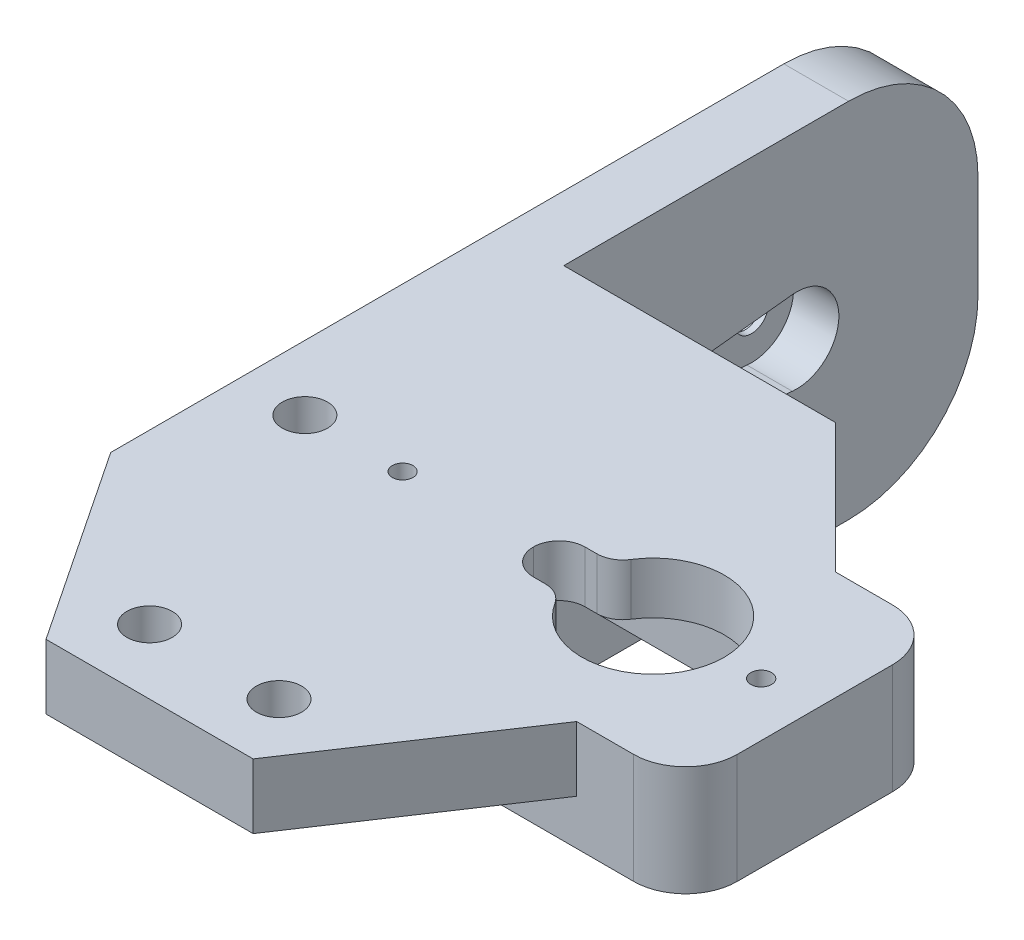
ISO-10303-21;
HEADER;
FILE_DESCRIPTION(('STEP AP214'),'2;1');
FILE_NAME('part.step','',(''),(''),'','','');
FILE_SCHEMA(('AUTOMOTIVE_DESIGN { 1 0 10303 214 1 1 1 1 }'));
ENDSEC;
DATA;
#1=APPLICATION_CONTEXT('core data for automotive mechanical design processes');
#2=APPLICATION_PROTOCOL_DEFINITION('international standard','automotive_design',2000,#1);
#3=PRODUCT_CONTEXT('',#1,'mechanical');
#4=PRODUCT('Part','Part','',(#3));
#5=PRODUCT_RELATED_PRODUCT_CATEGORY('part','',(#4));
#6=PRODUCT_DEFINITION_FORMATION('','',#4);
#7=PRODUCT_DEFINITION_CONTEXT('part definition',#1,'design');
#8=PRODUCT_DEFINITION('design','',#6,#7);
#9=PRODUCT_DEFINITION_SHAPE('','',#8);
#10=(LENGTH_UNIT() NAMED_UNIT(*) SI_UNIT(.MILLI.,.METRE.));
#11=(NAMED_UNIT(*) PLANE_ANGLE_UNIT() SI_UNIT($,.RADIAN.));
#12=(NAMED_UNIT(*) SI_UNIT($,.STERADIAN.) SOLID_ANGLE_UNIT());
#13=UNCERTAINTY_MEASURE_WITH_UNIT(LENGTH_MEASURE(1.E-05),#10,'distance_accuracy_value','');
#14=(GEOMETRIC_REPRESENTATION_CONTEXT(3) GLOBAL_UNCERTAINTY_ASSIGNED_CONTEXT((#13)) GLOBAL_UNIT_ASSIGNED_CONTEXT((#10,
#11,#12)) REPRESENTATION_CONTEXT('',''));
#15=CARTESIAN_POINT('',(0.,0.,0.));
#16=DIRECTION('',(0.,0.,1.));
#17=DIRECTION('',(1.,0.,0.));
#18=AXIS2_PLACEMENT_3D('',#15,#16,#17);
#19=CARTESIAN_POINT('',(0.,5.,-35.));
#20=DIRECTION('',(0.,0.,-1.));
#21=DIRECTION('',(-1.,0.,0.));
#22=AXIS2_PLACEMENT_3D('',#19,#20,#21);
#23=PLANE('',#22);
#24=DIRECTION('',(-1.,0.,0.));
#25=VECTOR('',#24,1.);
#26=CARTESIAN_POINT('',(0.,-3.5,-35.));
#27=LINE('',#26,#25);
#28=CARTESIAN_POINT('',(40.4000000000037,-3.5,-35.));
#29=VERTEX_POINT('',#28);
#30=CARTESIAN_POINT('',(13.,-3.5,-35.));
#31=VERTEX_POINT('',#30);
#32=EDGE_CURVE('E301',#29,#31,#27,.T.);
#33=ORIENTED_EDGE('',*,*,#32,.T.);
#34=DIRECTION('',(0.,-1.,0.));
#35=VECTOR('',#34,1.);
#36=CARTESIAN_POINT('',(13.,5.,-35.));
#37=LINE('',#36,#35);
#38=CARTESIAN_POINT('',(13.,0.,-35.0000000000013));
#39=VERTEX_POINT('',#38);
#40=EDGE_CURVE('E63',#31,#39,#37,.F.);
#41=ORIENTED_EDGE('',*,*,#40,.T.);
#42=DIRECTION('',(1.,0.,0.));
#43=VECTOR('',#42,1.);
#44=CARTESIAN_POINT('',(0.,0.,-35.0000000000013));
#45=LINE('',#44,#43);
#46=CARTESIAN_POINT('',(36.,0.,-35.));
#47=VERTEX_POINT('',#46);
#48=EDGE_CURVE('E443',#39,#47,#45,.T.);
#49=ORIENTED_EDGE('',*,*,#48,.T.);
#50=DIRECTION('',(0.,-1.,0.));
#51=VECTOR('',#50,1.);
#52=CARTESIAN_POINT('',(36.,5.,-35.));
#53=LINE('',#52,#51);
#54=CARTESIAN_POINT('',(36.,5.,-35.));
#55=VERTEX_POINT('',#54);
#56=EDGE_CURVE('E451',#55,#47,#53,.T.);
#57=ORIENTED_EDGE('',*,*,#56,.F.);
#58=DIRECTION('',(1.,0.,0.));
#59=VECTOR('',#58,1.);
#60=CARTESIAN_POINT('',(0.,5.,-35.));
#61=LINE('',#60,#59);
#62=CARTESIAN_POINT('',(40.4000000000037,5.,-35.));
#63=VERTEX_POINT('',#62);
#64=EDGE_CURVE('E460',#55,#63,#61,.T.);
#65=ORIENTED_EDGE('',*,*,#64,.T.);
#66=DIRECTION('',(0.,1.,0.));
#67=VECTOR('',#66,1.);
#68=CARTESIAN_POINT('',(40.4000000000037,-5.5,-35.));
#69=LINE('',#68,#67);
#70=EDGE_CURVE('E536',#63,#29,#69,.F.);
#71=ORIENTED_EDGE('',*,*,#70,.T.);
#72=EDGE_LOOP('',(#33,#41,#49,#57,#65,#71));
#73=FACE_BOUND('',#72,.T.);
#74=ADVANCED_FACE('F48',(#73),#23,.T.);
#75=CARTESIAN_POINT('',(0.,5.,-15.));
#76=DIRECTION('',(0.,0.,-1.));
#77=DIRECTION('',(-1.,0.,0.));
#78=AXIS2_PLACEMENT_3D('',#75,#76,#77);
#79=PLANE('',#78);
#80=DIRECTION('',(-1.,0.,0.));
#81=VECTOR('',#80,1.);
#82=CARTESIAN_POINT('',(0.,-3.5,-15.));
#83=LINE('',#82,#81);
#84=CARTESIAN_POINT('',(40.4000000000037,-3.5,-15.));
#85=VERTEX_POINT('',#84);
#86=CARTESIAN_POINT('',(9.40000000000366,-3.5,-15.));
#87=VERTEX_POINT('',#86);
#88=EDGE_CURVE('E328',#85,#87,#83,.T.);
#89=ORIENTED_EDGE('',*,*,#88,.F.);
#90=DIRECTION('',(0.,1.,0.));
#91=VECTOR('',#90,1.);
#92=CARTESIAN_POINT('',(40.4000000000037,5.,-15.));
#93=LINE('',#92,#91);
#94=CARTESIAN_POINT('',(40.4000000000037,5.,-15.));
#95=VERTEX_POINT('',#94);
#96=EDGE_CURVE('E539',#85,#95,#93,.T.);
#97=ORIENTED_EDGE('',*,*,#96,.T.);
#98=DIRECTION('',(1.,0.,0.));
#99=VECTOR('',#98,1.);
#100=CARTESIAN_POINT('',(0.,5.,-15.));
#101=LINE('',#100,#99);
#102=CARTESIAN_POINT('',(36.,5.,-15.));
#103=VERTEX_POINT('',#102);
#104=EDGE_CURVE('E479',#103,#95,#101,.T.);
#105=ORIENTED_EDGE('',*,*,#104,.F.);
#106=DIRECTION('',(0.,-1.,0.));
#107=VECTOR('',#106,1.);
#108=CARTESIAN_POINT('',(36.,5.,-15.));
#109=LINE('',#108,#107);
#110=CARTESIAN_POINT('',(36.,0.,-15.));
#111=VERTEX_POINT('',#110);
#112=EDGE_CURVE('E491',#103,#111,#109,.T.);
#113=ORIENTED_EDGE('',*,*,#112,.T.);
#114=DIRECTION('',(-1.,0.,0.));
#115=VECTOR('',#114,1.);
#116=CARTESIAN_POINT('',(0.,0.,-15.));
#117=LINE('',#116,#115);
#118=CARTESIAN_POINT('',(9.40000000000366,0.,-15.));
#119=VERTEX_POINT('',#118);
#120=EDGE_CURVE('E447',#111,#119,#117,.T.);
#121=ORIENTED_EDGE('',*,*,#120,.T.);
#122=DIRECTION('',(0.,1.,0.));
#123=VECTOR('',#122,1.);
#124=CARTESIAN_POINT('',(9.40000000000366,-5.5,-15.));
#125=LINE('',#124,#123);
#126=EDGE_CURVE('E453',#87,#119,#125,.T.);
#127=ORIENTED_EDGE('',*,*,#126,.F.);
#128=EDGE_LOOP('',(#89,#97,#105,#113,#121,#127));
#129=FACE_BOUND('',#128,.T.);
#130=ADVANCED_FACE('F642',(#129),#79,.F.);
#131=CARTESIAN_POINT('',(38.4000000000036,-5.5,0.));
#132=DIRECTION('',(-1.,0.,0.));
#133=DIRECTION('',(0.,0.,1.));
#134=AXIS2_PLACEMENT_3D('',#131,#132,#133);
#135=PLANE('',#134);
#136=DIRECTION('',(0.,1.,0.));
#137=VECTOR('',#136,1.);
#138=CARTESIAN_POINT('',(38.4000000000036,-5.5,-31.5000000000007));
#139=LINE('',#138,#137);
#140=CARTESIAN_POINT('',(38.4000000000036,-3.5,-31.5000000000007));
#141=VERTEX_POINT('',#140);
#142=CARTESIAN_POINT('',(38.4000000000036,1.,-31.5000000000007));
#143=VERTEX_POINT('',#142);
#144=EDGE_CURVE('E455',#141,#143,#139,.T.);
#145=ORIENTED_EDGE('',*,*,#144,.F.);
#146=DIRECTION('',(0.,0.,1.));
#147=VECTOR('',#146,1.);
#148=CARTESIAN_POINT('',(38.4000000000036,-3.5,0.));
#149=LINE('',#148,#147);
#150=CARTESIAN_POINT('',(38.4000000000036,-3.5,-18.5000000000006));
#151=VERTEX_POINT('',#150);
#152=EDGE_CURVE('E341',#141,#151,#149,.T.);
#153=ORIENTED_EDGE('',*,*,#152,.T.);
#154=DIRECTION('',(0.,1.,0.));
#155=VECTOR('',#154,1.);
#156=CARTESIAN_POINT('',(38.4000000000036,-5.5,-18.5000000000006));
#157=LINE('',#156,#155);
#158=CARTESIAN_POINT('',(38.4000000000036,1.,-18.5000000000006));
#159=VERTEX_POINT('',#158);
#160=EDGE_CURVE('E296',#151,#159,#157,.T.);
#161=ORIENTED_EDGE('',*,*,#160,.T.);
#162=DIRECTION('',(0.,0.,-1.));
#163=VECTOR('',#162,1.);
#164=CARTESIAN_POINT('',(38.4000000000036,1.,0.));
#165=LINE('',#164,#163);
#166=EDGE_CURVE('E570',#159,#143,#165,.T.);
#167=ORIENTED_EDGE('',*,*,#166,.T.);
#168=EDGE_LOOP('',(#145,#153,#161,#167));
#169=FACE_BOUND('',#168,.T.);
#170=ADVANCED_FACE('F648',(#169),#135,.T.);
#171=CARTESIAN_POINT('',(0.,-5.5,-31.5000000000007));
#172=DIRECTION('',(0.,0.,1.));
#173=DIRECTION('',(1.,0.,0.));
#174=AXIS2_PLACEMENT_3D('',#171,#172,#173);
#175=PLANE('',#174);
#176=DIRECTION('',(1.,0.,0.));
#177=VECTOR('',#176,1.);
#178=CARTESIAN_POINT('',(0.,1.,-31.5000000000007));
#179=LINE('',#178,#177);
#180=CARTESIAN_POINT('',(14.4000000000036,1.,-31.5000000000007));
#181=VERTEX_POINT('',#180);
#182=EDGE_CURVE('E442',#181,#143,#179,.T.);
#183=ORIENTED_EDGE('',*,*,#182,.F.);
#184=DIRECTION('',(0.,-1.,0.));
#185=VECTOR('',#184,1.);
#186=CARTESIAN_POINT('',(14.4000000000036,28.2946881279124,-31.5000000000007));
#187=LINE('',#186,#185);
#188=CARTESIAN_POINT('',(14.4000000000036,-3.5,-31.5000000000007));
#189=VERTEX_POINT('',#188);
#190=EDGE_CURVE('E311',#181,#189,#187,.T.);
#191=ORIENTED_EDGE('',*,*,#190,.T.);
#192=DIRECTION('',(1.,0.,0.));
#193=VECTOR('',#192,1.);
#194=CARTESIAN_POINT('',(0.,-3.5,-31.5000000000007));
#195=LINE('',#194,#193);
#196=EDGE_CURVE('E300',#189,#141,#195,.T.);
#197=ORIENTED_EDGE('',*,*,#196,.T.);
#198=ORIENTED_EDGE('',*,*,#144,.T.);
#199=EDGE_LOOP('',(#183,#191,#197,#198));
#200=FACE_BOUND('',#199,.T.);
#201=ADVANCED_FACE('F734',(#200),#175,.T.);
#202=CARTESIAN_POINT('',(44.4000000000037,-5.5,0.));
#203=DIRECTION('',(-1.,0.,0.));
#204=DIRECTION('',(0.,0.,1.));
#205=AXIS2_PLACEMENT_3D('',#202,#203,#204);
#206=PLANE('',#205);
#207=DIRECTION('',(0.,0.,1.));
#208=VECTOR('',#207,1.);
#209=CARTESIAN_POINT('',(44.4000000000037,-3.5,0.));
#210=LINE('',#209,#208);
#211=CARTESIAN_POINT('',(44.4000000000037,-3.5,-31.));
#212=VERTEX_POINT('',#211);
#213=CARTESIAN_POINT('',(44.4000000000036,-3.5,-19.));
#214=VERTEX_POINT('',#213);
#215=EDGE_CURVE('E334',#212,#214,#210,.T.);
#216=ORIENTED_EDGE('',*,*,#215,.F.);
#217=DIRECTION('',(0.,1.,0.));
#218=VECTOR('',#217,1.);
#219=CARTESIAN_POINT('',(44.4000000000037,5.,-31.));
#220=LINE('',#219,#218);
#221=CARTESIAN_POINT('',(44.4000000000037,5.,-31.));
#222=VERTEX_POINT('',#221);
#223=EDGE_CURVE('E530',#212,#222,#220,.T.);
#224=ORIENTED_EDGE('',*,*,#223,.T.);
#225=DIRECTION('',(0.,0.,-1.));
#226=VECTOR('',#225,1.);
#227=CARTESIAN_POINT('',(44.4000000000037,5.,-15.));
#228=LINE('',#227,#226);
#229=CARTESIAN_POINT('',(44.4000000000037,5.,-19.));
#230=VERTEX_POINT('',#229);
#231=EDGE_CURVE('E439',#230,#222,#228,.T.);
#232=ORIENTED_EDGE('',*,*,#231,.F.);
#233=DIRECTION('',(0.,1.,0.));
#234=VECTOR('',#233,1.);
#235=CARTESIAN_POINT('',(44.4000000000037,-5.5,-19.));
#236=LINE('',#235,#234);
#237=EDGE_CURVE('E450',#230,#214,#236,.F.);
#238=ORIENTED_EDGE('',*,*,#237,.T.);
#239=EDGE_LOOP('',(#216,#224,#232,#238));
#240=FACE_BOUND('',#239,.T.);
#241=ADVANCED_FACE('F736',(#240),#206,.F.);
#242=CARTESIAN_POINT('',(9.40000000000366,-5.5,0.));
#243=DIRECTION('',(-1.,0.,0.));
#244=DIRECTION('',(0.,0.,1.));
#245=AXIS2_PLACEMENT_3D('',#242,#243,#244);
#246=PLANE('',#245);
#247=DIRECTION('',(0.,0.,1.));
#248=VECTOR('',#247,1.);
#249=CARTESIAN_POINT('',(9.40000000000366,0.,0.));
#250=LINE('',#249,#248);
#251=CARTESIAN_POINT('',(9.40000000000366,0.,-28.));
#252=VERTEX_POINT('',#251);
#253=EDGE_CURVE('E445',#252,#119,#250,.T.);
#254=ORIENTED_EDGE('',*,*,#253,.F.);
#255=DIRECTION('',(0.,1.,0.));
#256=VECTOR('',#255,1.);
#257=CARTESIAN_POINT('',(9.40000000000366,-3.5,-28.));
#258=LINE('',#257,#256);
#259=CARTESIAN_POINT('',(9.40000000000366,-3.5,-28.));
#260=VERTEX_POINT('',#259);
#261=EDGE_CURVE('E615',#252,#260,#258,.F.);
#262=ORIENTED_EDGE('',*,*,#261,.T.);
#263=DIRECTION('',(0.,0.,1.));
#264=VECTOR('',#263,1.);
#265=CARTESIAN_POINT('',(9.40000000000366,-3.5,0.));
#266=LINE('',#265,#264);
#267=EDGE_CURVE('E326',#260,#87,#266,.T.);
#268=ORIENTED_EDGE('',*,*,#267,.T.);
#269=ORIENTED_EDGE('',*,*,#126,.T.);
#270=EDGE_LOOP('',(#254,#262,#268,#269));
#271=FACE_BOUND('',#270,.T.);
#272=ADVANCED_FACE('F742',(#271),#246,.T.);
#273=CARTESIAN_POINT('',(0.,-5.5,-18.5000000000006));
#274=DIRECTION('',(0.,0.,1.));
#275=DIRECTION('',(1.,0.,0.));
#276=AXIS2_PLACEMENT_3D('',#273,#274,#275);
#277=PLANE('',#276);
#278=DIRECTION('',(1.,0.,0.));
#279=VECTOR('',#278,1.);
#280=CARTESIAN_POINT('',(0.,-3.5,-18.5000000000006));
#281=LINE('',#280,#279);
#282=CARTESIAN_POINT('',(14.4000000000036,-3.5,-18.5000000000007));
#283=VERTEX_POINT('',#282);
#284=EDGE_CURVE('E291',#283,#151,#281,.T.);
#285=ORIENTED_EDGE('',*,*,#284,.F.);
#286=DIRECTION('',(0.,-1.,0.));
#287=VECTOR('',#286,1.);
#288=CARTESIAN_POINT('',(14.4000000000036,28.2946881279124,-18.5000000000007));
#289=LINE('',#288,#287);
#290=CARTESIAN_POINT('',(14.4000000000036,1.,-18.5000000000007));
#291=VERTEX_POINT('',#290);
#292=EDGE_CURVE('E295',#291,#283,#289,.T.);
#293=ORIENTED_EDGE('',*,*,#292,.F.);
#294=DIRECTION('',(1.,0.,0.));
#295=VECTOR('',#294,1.);
#296=CARTESIAN_POINT('',(0.,1.,-18.5000000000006));
#297=LINE('',#296,#295);
#298=EDGE_CURVE('E446',#291,#159,#297,.T.);
#299=ORIENTED_EDGE('',*,*,#298,.T.);
#300=ORIENTED_EDGE('',*,*,#160,.F.);
#301=EDGE_LOOP('',(#285,#293,#299,#300));
#302=FACE_BOUND('',#301,.T.);
#303=ADVANCED_FACE('F293',(#302),#277,.F.);
#304=CARTESIAN_POINT('',(40.4000000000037,-5.5,-31.));
#305=DIRECTION('',(0.,-1.,0.));
#306=DIRECTION('',(0.,0.,-1.));
#307=AXIS2_PLACEMENT_3D('',#304,#305,#306);
#308=CYLINDRICAL_SURFACE('',#307,4.);
#309=ORIENTED_EDGE('',*,*,#223,.F.);
#310=CARTESIAN_POINT('',(40.4000000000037,-3.5,-31.));
#311=DIRECTION('',(0.,-1.,0.));
#312=DIRECTION('',(0.,0.,-1.));
#313=AXIS2_PLACEMENT_3D('',#310,#311,#312);
#314=CIRCLE('',#313,4.);
#315=EDGE_CURVE('E336',#212,#29,#314,.F.);
#316=ORIENTED_EDGE('',*,*,#315,.T.);
#317=ORIENTED_EDGE('',*,*,#70,.F.);
#318=CARTESIAN_POINT('',(40.4000000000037,5.,-31.));
#319=DIRECTION('',(0.,1.,0.));
#320=DIRECTION('',(0.,0.,1.));
#321=AXIS2_PLACEMENT_3D('',#318,#319,#320);
#322=CIRCLE('',#321,4.);
#323=EDGE_CURVE('E534',#222,#63,#322,.T.);
#324=ORIENTED_EDGE('',*,*,#323,.F.);
#325=EDGE_LOOP('',(#309,#316,#317,#324));
#326=FACE_BOUND('',#325,.T.);
#327=ADVANCED_FACE('F655',(#326),#308,.T.);
#328=CARTESIAN_POINT('',(40.4000000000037,5.,-19.));
#329=DIRECTION('',(0.,1.,0.));
#330=DIRECTION('',(0.,0.,1.));
#331=AXIS2_PLACEMENT_3D('',#328,#329,#330);
#332=CYLINDRICAL_SURFACE('',#331,4.);
#333=ORIENTED_EDGE('',*,*,#96,.F.);
#334=CARTESIAN_POINT('',(40.4000000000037,-3.5,-19.));
#335=DIRECTION('',(0.,-1.,0.));
#336=DIRECTION('',(0.,0.,-1.));
#337=AXIS2_PLACEMENT_3D('',#334,#335,#336);
#338=CIRCLE('',#337,4.);
#339=EDGE_CURVE('E331',#85,#214,#338,.F.);
#340=ORIENTED_EDGE('',*,*,#339,.T.);
#341=ORIENTED_EDGE('',*,*,#237,.F.);
#342=CARTESIAN_POINT('',(40.4000000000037,5.,-19.));
#343=DIRECTION('',(0.,1.,0.));
#344=DIRECTION('',(0.,0.,1.));
#345=AXIS2_PLACEMENT_3D('',#342,#343,#344);
#346=CIRCLE('',#345,4.);
#347=EDGE_CURVE('E532',#95,#230,#346,.T.);
#348=ORIENTED_EDGE('',*,*,#347,.F.);
#349=EDGE_LOOP('',(#333,#340,#341,#348));
#350=FACE_BOUND('',#349,.T.);
#351=ADVANCED_FACE('F658',(#350),#332,.T.);
#352=CARTESIAN_POINT('',(1.49999999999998,-9.,-63.));
#353=DIRECTION('',(-1.,0.,0.));
#354=DIRECTION('',(0.,0.,1.));
#355=AXIS2_PLACEMENT_3D('',#352,#353,#354);
#356=CYLINDRICAL_SURFACE('',#355,1.3);
#357=CARTESIAN_POINT('',(1.49999999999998,-9.,-63.));
#358=DIRECTION('',(-1.,0.,0.));
#359=DIRECTION('',(0.,0.,1.));
#360=AXIS2_PLACEMENT_3D('',#357,#358,#359);
#361=CIRCLE('',#360,1.3);
#362=CARTESIAN_POINT('',(1.49999999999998,-9.,-61.7));
#363=VERTEX_POINT('',#362);
#364=EDGE_CURVE('E371',#363,#363,#361,.T.);
#365=ORIENTED_EDGE('',*,*,#364,.F.);
#366=EDGE_LOOP('',(#365));
#367=FACE_BOUND('',#366,.T.);
#368=CARTESIAN_POINT('',(1.,-9.,-63.));
#369=DIRECTION('',(-1.,0.,0.));
#370=DIRECTION('',(0.,0.,1.));
#371=AXIS2_PLACEMENT_3D('',#368,#369,#370);
#372=CIRCLE('',#371,1.3);
#373=CARTESIAN_POINT('',(1.,-9.,-61.7));
#374=VERTEX_POINT('',#373);
#375=EDGE_CURVE('E364',#374,#374,#372,.T.);
#376=ORIENTED_EDGE('',*,*,#375,.T.);
#377=EDGE_LOOP('',(#376));
#378=FACE_BOUND('',#377,.T.);
#379=ADVANCED_FACE('F662',(#367,#378),#356,.F.);
#380=CARTESIAN_POINT('',(10.,-23.,-33.));
#381=DIRECTION('',(0.,-1.,0.));
#382=DIRECTION('',(0.,0.,-1.));
#383=AXIS2_PLACEMENT_3D('',#380,#381,#382);
#384=PLANE('',#383);
#385=DIRECTION('',(0.,0.,-1.));
#386=VECTOR('',#385,1.);
#387=CARTESIAN_POINT('',(5.,-23.,-33.));
#388=LINE('',#387,#386);
#389=CARTESIAN_POINT('',(5.,-23.,-43.));
#390=VERTEX_POINT('',#389);
#391=CARTESIAN_POINT('',(5.,-23.,-67.));
#392=VERTEX_POINT('',#391);
#393=EDGE_CURVE('E425',#390,#392,#388,.T.);
#394=ORIENTED_EDGE('',*,*,#393,.F.);
#395=DIRECTION('',(-1.,0.,0.));
#396=VECTOR('',#395,1.);
#397=CARTESIAN_POINT('',(10.,-23.,-43.));
#398=LINE('',#397,#396);
#399=CARTESIAN_POINT('',(0.,-23.,-43.));
#400=VERTEX_POINT('',#399);
#401=EDGE_CURVE('E544',#390,#400,#398,.T.);
#402=ORIENTED_EDGE('',*,*,#401,.T.);
#403=DIRECTION('',(0.,0.,-1.));
#404=VECTOR('',#403,1.);
#405=CARTESIAN_POINT('',(0.,-23.,-33.));
#406=LINE('',#405,#404);
#407=CARTESIAN_POINT('',(0.,-23.,-67.));
#408=VERTEX_POINT('',#407);
#409=EDGE_CURVE('E433',#400,#408,#406,.T.);
#410=ORIENTED_EDGE('',*,*,#409,.T.);
#411=DIRECTION('',(-1.,0.,0.));
#412=VECTOR('',#411,1.);
#413=CARTESIAN_POINT('',(10.,-23.,-67.));
#414=LINE('',#413,#412);
#415=EDGE_CURVE('E541',#408,#392,#414,.F.);
#416=ORIENTED_EDGE('',*,*,#415,.T.);
#417=EDGE_LOOP('',(#394,#402,#410,#416));
#418=FACE_BOUND('',#417,.T.);
#419=ADVANCED_FACE('F667',(#418),#384,.T.);
#420=CARTESIAN_POINT('',(10.,-13.,-43.));
#421=DIRECTION('',(-1.,0.,0.));
#422=DIRECTION('',(0.,0.,1.));
#423=AXIS2_PLACEMENT_3D('',#420,#421,#422);
#424=CYLINDRICAL_SURFACE('',#423,10.);
#425=ORIENTED_EDGE('',*,*,#401,.F.);
#426=CARTESIAN_POINT('',(5.,-13.,-43.));
#427=DIRECTION('',(1.,0.,0.));
#428=DIRECTION('',(0.,1.,0.));
#429=AXIS2_PLACEMENT_3D('',#426,#427,#428);
#430=CIRCLE('',#429,10.);
#431=CARTESIAN_POINT('',(5.,-13.,-33.));
#432=VERTEX_POINT('',#431);
#433=EDGE_CURVE('E413',#432,#390,#430,.T.);
#434=ORIENTED_EDGE('',*,*,#433,.F.);
#435=DIRECTION('',(-1.,0.,0.));
#436=VECTOR('',#435,1.);
#437=CARTESIAN_POINT('',(0.,-13.,-33.));
#438=LINE('',#437,#436);
#439=CARTESIAN_POINT('',(0.,-13.,-33.));
#440=VERTEX_POINT('',#439);
#441=EDGE_CURVE('E552',#440,#432,#438,.F.);
#442=ORIENTED_EDGE('',*,*,#441,.F.);
#443=CARTESIAN_POINT('',(0.,-13.,-43.));
#444=DIRECTION('',(-1.,0.,0.));
#445=DIRECTION('',(0.,0.,1.));
#446=AXIS2_PLACEMENT_3D('',#443,#444,#445);
#447=CIRCLE('',#446,10.);
#448=EDGE_CURVE('E550',#400,#440,#447,.T.);
#449=ORIENTED_EDGE('',*,*,#448,.F.);
#450=EDGE_LOOP('',(#425,#434,#442,#449));
#451=FACE_BOUND('',#450,.T.);
#452=ADVANCED_FACE('F664',(#451),#424,.T.);
#453=CARTESIAN_POINT('',(0.,0.,0.));
#454=DIRECTION('',(0.,1.,0.));
#455=DIRECTION('',(0.,0.,1.));
#456=AXIS2_PLACEMENT_3D('',#453,#454,#455);
#457=PLANE('',#456);
#458=ORIENTED_EDGE('',*,*,#48,.F.);
#459=CARTESIAN_POINT('',(13.,0.,-43.));
#460=DIRECTION('',(0.,1.,0.));
#461=DIRECTION('',(0.,0.,1.));
#462=AXIS2_PLACEMENT_3D('',#459,#460,#461);
#463=CIRCLE('',#462,8.);
#464=CARTESIAN_POINT('',(5.,0.,-43.));
#465=VERTEX_POINT('',#464);
#466=EDGE_CURVE('E56',#39,#465,#463,.F.);
#467=ORIENTED_EDGE('',*,*,#466,.T.);
#468=DIRECTION('',(0.,0.,1.));
#469=VECTOR('',#468,1.);
#470=CARTESIAN_POINT('',(5.,0.,-45.));
#471=LINE('',#470,#469);
#472=CARTESIAN_POINT('',(5.,0.,-45.));
#473=VERTEX_POINT('',#472);
#474=EDGE_CURVE('E402',#473,#465,#471,.T.);
#475=ORIENTED_EDGE('',*,*,#474,.F.);
#476=DIRECTION('',(1.,0.,0.));
#477=VECTOR('',#476,1.);
#478=CARTESIAN_POINT('',(0.,0.,-45.));
#479=LINE('',#478,#477);
#480=CARTESIAN_POINT('',(26.,0.,-45.));
#481=VERTEX_POINT('',#480);
#482=EDGE_CURVE('E494',#473,#481,#479,.T.);
#483=ORIENTED_EDGE('',*,*,#482,.T.);
#484=DIRECTION('',(0.707106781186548,0.,0.707106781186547));
#485=VECTOR('',#484,1.);
#486=CARTESIAN_POINT('',(35.5,0.,-35.5));
#487=LINE('',#486,#485);
#488=EDGE_CURVE('E457',#481,#47,#487,.T.);
#489=ORIENTED_EDGE('',*,*,#488,.T.);
#490=EDGE_LOOP('',(#458,#467,#475,#483,#489));
#491=FACE_BOUND('',#490,.T.);
#492=ADVANCED_FACE('F625',(#491),#457,.F.);
#493=CARTESIAN_POINT('',(5.,0.,-25.));
#494=DIRECTION('',(0.,1.,0.));
#495=DIRECTION('',(0.,0.,1.));
#496=AXIS2_PLACEMENT_3D('',#493,#494,#495);
#497=CIRCLE('',#496,1.75);
#498=CARTESIAN_POINT('',(5.,0.,-23.25));
#499=VERTEX_POINT('',#498);
#500=EDGE_CURVE('E506',#499,#499,#497,.T.);
#501=ORIENTED_EDGE('',*,*,#500,.T.);
#502=EDGE_LOOP('',(#501));
#503=FACE_BOUND('',#502,.T.);
#504=CARTESIAN_POINT('',(13.,0.,-5.));
#505=DIRECTION('',(0.,1.,0.));
#506=DIRECTION('',(0.,0.,1.));
#507=AXIS2_PLACEMENT_3D('',#504,#505,#506);
#508=CIRCLE('',#507,1.75);
#509=CARTESIAN_POINT('',(13.,0.,-3.25));
#510=VERTEX_POINT('',#509);
#511=EDGE_CURVE('E509',#510,#510,#508,.T.);
#512=ORIENTED_EDGE('',*,*,#511,.T.);
#513=EDGE_LOOP('',(#512));
#514=FACE_BOUND('',#513,.T.);
#515=CARTESIAN_POINT('',(23.,0.,-5.));
#516=DIRECTION('',(0.,1.,0.));
#517=DIRECTION('',(0.,0.,1.));
#518=AXIS2_PLACEMENT_3D('',#515,#516,#517);
#519=CIRCLE('',#518,1.75);
#520=CARTESIAN_POINT('',(23.,0.,-3.25));
#521=VERTEX_POINT('',#520);
#522=EDGE_CURVE('E464',#521,#521,#519,.T.);
#523=ORIENTED_EDGE('',*,*,#522,.T.);
#524=EDGE_LOOP('',(#523));
#525=FACE_BOUND('',#524,.T.);
#526=DIRECTION('',(1.,0.,0.));
#527=VECTOR('',#526,1.);
#528=CARTESIAN_POINT('',(0.,0.,-33.));
#529=LINE('',#528,#527);
#530=CARTESIAN_POINT('',(0.,0.,-33.));
#531=VERTEX_POINT('',#530);
#532=CARTESIAN_POINT('',(4.40000000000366,0.,-33.));
#533=VERTEX_POINT('',#532);
#534=EDGE_CURVE('E436',#531,#533,#529,.T.);
#535=ORIENTED_EDGE('',*,*,#534,.T.);
#536=CARTESIAN_POINT('',(4.40000000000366,0.,-28.));
#537=DIRECTION('',(0.,1.,0.));
#538=DIRECTION('',(0.,0.,1.));
#539=AXIS2_PLACEMENT_3D('',#536,#537,#538);
#540=CIRCLE('',#539,5.);
#541=EDGE_CURVE('E613',#533,#252,#540,.F.);
#542=ORIENTED_EDGE('',*,*,#541,.T.);
#543=ORIENTED_EDGE('',*,*,#253,.T.);
#544=ORIENTED_EDGE('',*,*,#120,.F.);
#545=DIRECTION('',(0.554700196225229,0.,-0.832050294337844));
#546=VECTOR('',#545,1.);
#547=CARTESIAN_POINT('',(18.,0.,12.));
#548=LINE('',#547,#546);
#549=CARTESIAN_POINT('',(26.,0.,0.));
#550=VERTEX_POINT('',#549);
#551=EDGE_CURVE('E503',#550,#111,#548,.T.);
#552=ORIENTED_EDGE('',*,*,#551,.F.);
#553=DIRECTION('',(1.,0.,0.));
#554=VECTOR('',#553,1.);
#555=CARTESIAN_POINT('',(0.,0.,0.));
#556=LINE('',#555,#554);
#557=CARTESIAN_POINT('',(10.,0.,0.));
#558=VERTEX_POINT('',#557);
#559=EDGE_CURVE('E501',#558,#550,#556,.T.);
#560=ORIENTED_EDGE('',*,*,#559,.F.);
#561=DIRECTION('',(0.554700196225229,0.,0.832050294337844));
#562=VECTOR('',#561,1.);
#563=CARTESIAN_POINT('',(6.92307692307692,0.,-4.61538461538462));
#564=LINE('',#563,#562);
#565=CARTESIAN_POINT('',(0.,0.,-15.));
#566=VERTEX_POINT('',#565);
#567=EDGE_CURVE('E499',#566,#558,#564,.T.);
#568=ORIENTED_EDGE('',*,*,#567,.F.);
#569=DIRECTION('',(0.,0.,-1.));
#570=VECTOR('',#569,1.);
#571=CARTESIAN_POINT('',(0.,0.,0.));
#572=LINE('',#571,#570);
#573=EDGE_CURVE('E497',#566,#531,#572,.T.);
#574=ORIENTED_EDGE('',*,*,#573,.T.);
#575=EDGE_LOOP('',(#535,#542,#543,#544,#552,#560,#568,#574));
#576=FACE_BOUND('',#575,.T.);
#577=ADVANCED_FACE('F757',(#503,#514,#525,#576),#457,.F.);
#578=CARTESIAN_POINT('',(35.5,5.,-35.5));
#579=DIRECTION('',(0.707106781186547,0.,-0.707106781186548));
#580=DIRECTION('',(-0.707106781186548,0.,-0.707106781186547));
#581=AXIS2_PLACEMENT_3D('',#578,#579,#580);
#582=PLANE('',#581);
#583=ORIENTED_EDGE('',*,*,#488,.F.);
#584=DIRECTION('',(0.,-1.,0.));
#585=VECTOR('',#584,1.);
#586=CARTESIAN_POINT('',(26.,5.,-45.));
#587=LINE('',#586,#585);
#588=CARTESIAN_POINT('',(26.,5.,-45.));
#589=VERTEX_POINT('',#588);
#590=EDGE_CURVE('E524',#589,#481,#587,.T.);
#591=ORIENTED_EDGE('',*,*,#590,.F.);
#592=DIRECTION('',(0.707106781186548,0.,0.707106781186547));
#593=VECTOR('',#592,1.);
#594=CARTESIAN_POINT('',(35.5,5.,-35.5));
#595=LINE('',#594,#593);
#596=EDGE_CURVE('E463',#589,#55,#595,.T.);
#597=ORIENTED_EDGE('',*,*,#596,.T.);
#598=ORIENTED_EDGE('',*,*,#56,.T.);
#599=EDGE_LOOP('',(#583,#591,#597,#598));
#600=FACE_BOUND('',#599,.T.);
#601=ADVANCED_FACE('F653',(#600),#582,.T.);
#602=CARTESIAN_POINT('',(0.,5.,-45.));
#603=DIRECTION('',(0.,0.,-1.));
#604=DIRECTION('',(-1.,0.,0.));
#605=AXIS2_PLACEMENT_3D('',#602,#603,#604);
#606=PLANE('',#605);
#607=ORIENTED_EDGE('',*,*,#482,.F.);
#608=DIRECTION('',(0.,1.,0.));
#609=VECTOR('',#608,1.);
#610=CARTESIAN_POINT('',(5.,-25.,-45.));
#611=LINE('',#610,#609);
#612=CARTESIAN_POINT('',(5.,5.,-45.));
#613=VERTEX_POINT('',#612);
#614=EDGE_CURVE('E420',#473,#613,#611,.T.);
#615=ORIENTED_EDGE('',*,*,#614,.T.);
#616=DIRECTION('',(1.,0.,0.));
#617=VECTOR('',#616,1.);
#618=CARTESIAN_POINT('',(0.,5.,-45.));
#619=LINE('',#618,#617);
#620=EDGE_CURVE('E467',#613,#589,#619,.T.);
#621=ORIENTED_EDGE('',*,*,#620,.T.);
#622=ORIENTED_EDGE('',*,*,#590,.T.);
#623=EDGE_LOOP('',(#607,#615,#621,#622));
#624=FACE_BOUND('',#623,.T.);
#625=ADVANCED_FACE('F786',(#624),#606,.T.);
#626=CARTESIAN_POINT('',(0.,5.,0.));
#627=DIRECTION('',(-1.,0.,0.));
#628=DIRECTION('',(0.,0.,1.));
#629=AXIS2_PLACEMENT_3D('',#626,#627,#628);
#630=PLANE('',#629);
#631=CARTESIAN_POINT('',(0.,-9.,-49.));
#632=DIRECTION('',(-1.,0.,0.));
#633=DIRECTION('',(0.,0.,1.));
#634=AXIS2_PLACEMENT_3D('',#631,#632,#633);
#635=CIRCLE('',#634,0.75);
#636=CARTESIAN_POINT('',(0.,-9.,-48.25));
#637=VERTEX_POINT('',#636);
#638=EDGE_CURVE('E360',#637,#637,#635,.T.);
#639=ORIENTED_EDGE('',*,*,#638,.F.);
#640=EDGE_LOOP('',(#639));
#641=FACE_BOUND('',#640,.T.);
#642=CARTESIAN_POINT('',(0.,-9.,-63.));
#643=DIRECTION('',(-1.,0.,0.));
#644=DIRECTION('',(0.,0.,1.));
#645=AXIS2_PLACEMENT_3D('',#642,#643,#644);
#646=CIRCLE('',#645,2.35);
#647=CARTESIAN_POINT('',(0.,-9.,-60.65));
#648=VERTEX_POINT('',#647);
#649=EDGE_CURVE('E367',#648,#648,#646,.T.);
#650=ORIENTED_EDGE('',*,*,#649,.F.);
#651=EDGE_LOOP('',(#650));
#652=FACE_BOUND('',#651,.T.);
#653=ORIENTED_EDGE('',*,*,#409,.F.);
#654=ORIENTED_EDGE('',*,*,#448,.T.);
#655=DIRECTION('',(0.,-1.,0.));
#656=VECTOR('',#655,1.);
#657=CARTESIAN_POINT('',(0.,5.,-33.));
#658=LINE('',#657,#656);
#659=EDGE_CURVE('E430',#531,#440,#658,.T.);
#660=ORIENTED_EDGE('',*,*,#659,.F.);
#661=ORIENTED_EDGE('',*,*,#573,.F.);
#662=DIRECTION('',(0.,-1.,0.));
#663=VECTOR('',#662,1.);
#664=CARTESIAN_POINT('',(0.,5.,-15.));
#665=LINE('',#664,#663);
#666=CARTESIAN_POINT('',(0.,5.,-15.));
#667=VERTEX_POINT('',#666);
#668=EDGE_CURVE('E522',#667,#566,#665,.T.);
#669=ORIENTED_EDGE('',*,*,#668,.F.);
#670=DIRECTION('',(0.,0.,-1.));
#671=VECTOR('',#670,1.);
#672=CARTESIAN_POINT('',(0.,5.,0.));
#673=LINE('',#672,#671);
#674=CARTESIAN_POINT('',(0.,5.,-67.));
#675=VERTEX_POINT('',#674);
#676=EDGE_CURVE('E470',#667,#675,#673,.T.);
#677=ORIENTED_EDGE('',*,*,#676,.T.);
#678=CARTESIAN_POINT('',(0.,-5.,-67.));
#679=DIRECTION('',(-1.,0.,0.));
#680=DIRECTION('',(0.,0.,1.));
#681=AXIS2_PLACEMENT_3D('',#678,#679,#680);
#682=CIRCLE('',#681,10.);
#683=CARTESIAN_POINT('',(0.,-5.,-77.));
#684=VERTEX_POINT('',#683);
#685=EDGE_CURVE('E546',#675,#684,#682,.T.);
#686=ORIENTED_EDGE('',*,*,#685,.T.);
#687=DIRECTION('',(0.,-1.,0.));
#688=VECTOR('',#687,1.);
#689=CARTESIAN_POINT('',(0.,5.,-77.));
#690=LINE('',#689,#688);
#691=CARTESIAN_POINT('',(0.,-13.,-77.));
#692=VERTEX_POINT('',#691);
#693=EDGE_CURVE('E427',#684,#692,#690,.T.);
#694=ORIENTED_EDGE('',*,*,#693,.T.);
#695=CARTESIAN_POINT('',(0.,-13.,-67.));
#696=DIRECTION('',(-1.,0.,0.));
#697=DIRECTION('',(0.,0.,1.));
#698=AXIS2_PLACEMENT_3D('',#695,#696,#697);
#699=CIRCLE('',#698,10.);
#700=EDGE_CURVE('E548',#692,#408,#699,.T.);
#701=ORIENTED_EDGE('',*,*,#700,.T.);
#702=EDGE_LOOP('',(#653,#654,#660,#661,#669,#677,#686,#694,#701));
#703=FACE_BOUND('',#702,.T.);
#704=ADVANCED_FACE('F783',(#641,#652,#703),#630,.T.);
#705=CARTESIAN_POINT('',(6.92307692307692,5.,-4.61538461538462));
#706=DIRECTION('',(0.832050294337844,0.,-0.554700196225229));
#707=DIRECTION('',(-0.554700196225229,0.,-0.832050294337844));
#708=AXIS2_PLACEMENT_3D('',#705,#706,#707);
#709=PLANE('',#708);
#710=ORIENTED_EDGE('',*,*,#567,.T.);
#711=DIRECTION('',(0.,-1.,0.));
#712=VECTOR('',#711,1.);
#713=CARTESIAN_POINT('',(10.,5.,0.));
#714=LINE('',#713,#712);
#715=CARTESIAN_POINT('',(10.,5.,0.));
#716=VERTEX_POINT('',#715);
#717=EDGE_CURVE('E519',#716,#558,#714,.T.);
#718=ORIENTED_EDGE('',*,*,#717,.F.);
#719=DIRECTION('',(0.554700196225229,0.,0.832050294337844));
#720=VECTOR('',#719,1.);
#721=CARTESIAN_POINT('',(6.92307692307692,5.,-4.61538461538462));
#722=LINE('',#721,#720);
#723=EDGE_CURVE('E473',#667,#716,#722,.T.);
#724=ORIENTED_EDGE('',*,*,#723,.F.);
#725=ORIENTED_EDGE('',*,*,#668,.T.);
#726=EDGE_LOOP('',(#710,#718,#724,#725));
#727=FACE_BOUND('',#726,.T.);
#728=ADVANCED_FACE('F779',(#727),#709,.F.);
#729=CARTESIAN_POINT('',(0.,5.,0.));
#730=DIRECTION('',(0.,0.,-1.));
#731=DIRECTION('',(-1.,0.,0.));
#732=AXIS2_PLACEMENT_3D('',#729,#730,#731);
#733=PLANE('',#732);
#734=ORIENTED_EDGE('',*,*,#559,.T.);
#735=DIRECTION('',(0.,-1.,0.));
#736=VECTOR('',#735,1.);
#737=CARTESIAN_POINT('',(26.,5.,0.));
#738=LINE('',#737,#736);
#739=CARTESIAN_POINT('',(26.,5.,0.));
#740=VERTEX_POINT('',#739);
#741=EDGE_CURVE('E516',#740,#550,#738,.T.);
#742=ORIENTED_EDGE('',*,*,#741,.F.);
#743=DIRECTION('',(1.,0.,0.));
#744=VECTOR('',#743,1.);
#745=CARTESIAN_POINT('',(0.,5.,0.));
#746=LINE('',#745,#744);
#747=EDGE_CURVE('E475',#716,#740,#746,.T.);
#748=ORIENTED_EDGE('',*,*,#747,.F.);
#749=ORIENTED_EDGE('',*,*,#717,.T.);
#750=EDGE_LOOP('',(#734,#742,#748,#749));
#751=FACE_BOUND('',#750,.T.);
#752=ADVANCED_FACE('F775',(#751),#733,.F.);
#753=CARTESIAN_POINT('',(18.,5.,12.));
#754=DIRECTION('',(-0.832050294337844,0.,-0.554700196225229));
#755=DIRECTION('',(-0.554700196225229,0.,0.832050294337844));
#756=AXIS2_PLACEMENT_3D('',#753,#754,#755);
#757=PLANE('',#756);
#758=ORIENTED_EDGE('',*,*,#551,.T.);
#759=ORIENTED_EDGE('',*,*,#112,.F.);
#760=DIRECTION('',(0.554700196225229,0.,-0.832050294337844));
#761=VECTOR('',#760,1.);
#762=CARTESIAN_POINT('',(18.,5.,12.));
#763=LINE('',#762,#761);
#764=EDGE_CURVE('E477',#740,#103,#763,.T.);
#765=ORIENTED_EDGE('',*,*,#764,.F.);
#766=ORIENTED_EDGE('',*,*,#741,.T.);
#767=EDGE_LOOP('',(#758,#759,#765,#766));
#768=FACE_BOUND('',#767,.T.);
#769=ADVANCED_FACE('F768',(#768),#757,.F.);
#770=CARTESIAN_POINT('',(13.,5.,-5.));
#771=DIRECTION('',(0.,-1.,0.));
#772=DIRECTION('',(0.,0.,-1.));
#773=AXIS2_PLACEMENT_3D('',#770,#771,#772);
#774=CYLINDRICAL_SURFACE('',#773,1.75);
#775=CARTESIAN_POINT('',(13.,5.,-5.));
#776=DIRECTION('',(0.,1.,0.));
#777=DIRECTION('',(0.,0.,1.));
#778=AXIS2_PLACEMENT_3D('',#775,#776,#777);
#779=CIRCLE('',#778,1.75);
#780=CARTESIAN_POINT('',(13.,5.,-3.25));
#781=VERTEX_POINT('',#780);
#782=EDGE_CURVE('E485',#781,#781,#779,.T.);
#783=ORIENTED_EDGE('',*,*,#782,.T.);
#784=EDGE_LOOP('',(#783));
#785=FACE_BOUND('',#784,.T.);
#786=ORIENTED_EDGE('',*,*,#511,.F.);
#787=EDGE_LOOP('',(#786));
#788=FACE_BOUND('',#787,.T.);
#789=ADVANCED_FACE('F765',(#785,#788),#774,.F.);
#790=CARTESIAN_POINT('',(5.,5.,-25.));
#791=DIRECTION('',(0.,-1.,0.));
#792=DIRECTION('',(0.,0.,-1.));
#793=AXIS2_PLACEMENT_3D('',#790,#791,#792);
#794=CYLINDRICAL_SURFACE('',#793,1.75);
#795=CARTESIAN_POINT('',(5.,5.,-25.));
#796=DIRECTION('',(0.,1.,0.));
#797=DIRECTION('',(0.,0.,1.));
#798=AXIS2_PLACEMENT_3D('',#795,#796,#797);
#799=CIRCLE('',#798,1.75);
#800=CARTESIAN_POINT('',(5.,5.,-23.25));
#801=VERTEX_POINT('',#800);
#802=EDGE_CURVE('E482',#801,#801,#799,.T.);
#803=ORIENTED_EDGE('',*,*,#802,.T.);
#804=EDGE_LOOP('',(#803));
#805=FACE_BOUND('',#804,.T.);
#806=ORIENTED_EDGE('',*,*,#500,.F.);
#807=EDGE_LOOP('',(#806));
#808=FACE_BOUND('',#807,.T.);
#809=ADVANCED_FACE('F763',(#805,#808),#794,.F.);
#810=CARTESIAN_POINT('',(23.,5.,-5.));
#811=DIRECTION('',(0.,-1.,0.));
#812=DIRECTION('',(0.,0.,-1.));
#813=AXIS2_PLACEMENT_3D('',#810,#811,#812);
#814=CYLINDRICAL_SURFACE('',#813,1.75);
#815=CARTESIAN_POINT('',(23.,5.,-5.));
#816=DIRECTION('',(0.,1.,0.));
#817=DIRECTION('',(0.,0.,1.));
#818=AXIS2_PLACEMENT_3D('',#815,#816,#817);
#819=CIRCLE('',#818,1.75);
#820=CARTESIAN_POINT('',(23.,5.,-3.25));
#821=VERTEX_POINT('',#820);
#822=EDGE_CURVE('E488',#821,#821,#819,.T.);
#823=ORIENTED_EDGE('',*,*,#822,.T.);
#824=EDGE_LOOP('',(#823));
#825=FACE_BOUND('',#824,.T.);
#826=ORIENTED_EDGE('',*,*,#522,.F.);
#827=EDGE_LOOP('',(#826));
#828=FACE_BOUND('',#827,.T.);
#829=ADVANCED_FACE('F755',(#825,#828),#814,.F.);
#830=CARTESIAN_POINT('',(0.,5.,0.));
#831=DIRECTION('',(0.,1.,0.));
#832=DIRECTION('',(0.,0.,1.));
#833=AXIS2_PLACEMENT_3D('',#830,#831,#832);
#834=PLANE('',#833);
#835=CARTESIAN_POINT('',(40.25,5.,-25.));
#836=DIRECTION('',(0.,-1.,0.));
#837=DIRECTION('',(0.,0.,-1.));
#838=AXIS2_PLACEMENT_3D('',#835,#836,#837);
#839=CIRCLE('',#838,0.799999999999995);
#840=CARTESIAN_POINT('',(40.25,5.,-25.8));
#841=VERTEX_POINT('',#840);
#842=EDGE_CURVE('E1193',#841,#841,#839,.T.);
#843=ORIENTED_EDGE('',*,*,#842,.T.);
#844=EDGE_LOOP('',(#843));
#845=FACE_BOUND('',#844,.T.);
#846=CARTESIAN_POINT('',(12.55,5.,-25.));
#847=DIRECTION('',(0.,-1.,0.));
#848=DIRECTION('',(0.,0.,-1.));
#849=AXIS2_PLACEMENT_3D('',#846,#847,#848);
#850=CIRCLE('',#849,0.799999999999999);
#851=CARTESIAN_POINT('',(12.55,5.,-25.8));
#852=VERTEX_POINT('',#851);
#853=EDGE_CURVE('E316',#852,#852,#850,.T.);
#854=ORIENTED_EDGE('',*,*,#853,.T.);
#855=EDGE_LOOP('',(#854));
#856=FACE_BOUND('',#855,.T.);
#857=CARTESIAN_POINT('',(31.9,5.,-25.));
#858=DIRECTION('',(0.,1.,0.));
#859=DIRECTION('',(0.,0.,1.));
#860=AXIS2_PLACEMENT_3D('',#857,#858,#859);
#861=CIRCLE('',#860,5.5);
#862=CARTESIAN_POINT('',(27.2475215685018,5.,-22.0666666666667));
#863=VERTEX_POINT('',#862);
#864=CARTESIAN_POINT('',(27.2475215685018,5.,-27.9333333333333));
#865=VERTEX_POINT('',#864);
#866=EDGE_CURVE('E357',#863,#865,#861,.T.);
#867=ORIENTED_EDGE('',*,*,#866,.F.);
#868=CARTESIAN_POINT('',(25.5557112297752,5.,-21.));
#869=DIRECTION('',(0.,1.,0.));
#870=DIRECTION('',(0.,0.,1.));
#871=AXIS2_PLACEMENT_3D('',#868,#869,#870);
#872=CIRCLE('',#871,2.);
#873=CARTESIAN_POINT('',(25.5557112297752,5.,-23.));
#874=VERTEX_POINT('',#873);
#875=EDGE_CURVE('E591',#863,#874,#872,.T.);
#876=ORIENTED_EDGE('',*,*,#875,.T.);
#877=DIRECTION('',(1.,0.,0.));
#878=VECTOR('',#877,1.);
#879=CARTESIAN_POINT('',(30.1542825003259,5.,-23.));
#880=LINE('',#879,#878);
#881=CARTESIAN_POINT('',(24.6457174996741,5.,-23.));
#882=VERTEX_POINT('',#881);
#883=EDGE_CURVE('E344',#882,#874,#880,.T.);
#884=ORIENTED_EDGE('',*,*,#883,.F.);
#885=CARTESIAN_POINT('',(24.6457174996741,5.,-25.));
#886=DIRECTION('',(0.,1.,0.));
#887=DIRECTION('',(0.,0.,1.));
#888=AXIS2_PLACEMENT_3D('',#885,#886,#887);
#889=CIRCLE('',#888,2.);
#890=CARTESIAN_POINT('',(22.6457174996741,5.,-25.));
#891=VERTEX_POINT('',#890);
#892=EDGE_CURVE('E601',#882,#891,#889,.F.);
#893=ORIENTED_EDGE('',*,*,#892,.T.);
#894=CARTESIAN_POINT('',(24.6457174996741,5.,-25.));
#895=DIRECTION('',(0.,1.,0.));
#896=DIRECTION('',(0.,0.,1.));
#897=AXIS2_PLACEMENT_3D('',#894,#895,#896);
#898=CIRCLE('',#897,2.);
#899=CARTESIAN_POINT('',(24.6457174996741,5.,-27.));
#900=VERTEX_POINT('',#899);
#901=EDGE_CURVE('E597',#891,#900,#898,.F.);
#902=ORIENTED_EDGE('',*,*,#901,.T.);
#903=DIRECTION('',(-1.,0.,0.));
#904=VECTOR('',#903,1.);
#905=CARTESIAN_POINT('',(30.1542825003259,5.,-27.));
#906=LINE('',#905,#904);
#907=CARTESIAN_POINT('',(25.5557112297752,5.,-27.));
#908=VERTEX_POINT('',#907);
#909=EDGE_CURVE('E347',#908,#900,#906,.T.);
#910=ORIENTED_EDGE('',*,*,#909,.F.);
#911=CARTESIAN_POINT('',(25.5557112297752,5.,-29.));
#912=DIRECTION('',(0.,1.,0.));
#913=DIRECTION('',(0.,0.,1.));
#914=AXIS2_PLACEMENT_3D('',#911,#912,#913);
#915=CIRCLE('',#914,2.);
#916=EDGE_CURVE('E589',#908,#865,#915,.T.);
#917=ORIENTED_EDGE('',*,*,#916,.T.);
#918=EDGE_LOOP('',(#867,#876,#884,#893,#902,#910,#917));
#919=FACE_BOUND('',#918,.T.);
#920=ORIENTED_EDGE('',*,*,#620,.F.);
#921=DIRECTION('',(0.,0.,1.));
#922=VECTOR('',#921,1.);
#923=CARTESIAN_POINT('',(5.,5.,-77.));
#924=LINE('',#923,#922);
#925=CARTESIAN_POINT('',(5.,5.,-67.));
#926=VERTEX_POINT('',#925);
#927=EDGE_CURVE('E416',#926,#613,#924,.T.);
#928=ORIENTED_EDGE('',*,*,#927,.F.);
#929=DIRECTION('',(-1.,0.,0.));
#930=VECTOR('',#929,1.);
#931=CARTESIAN_POINT('',(0.,5.,-67.));
#932=LINE('',#931,#930);
#933=EDGE_CURVE('E560',#926,#675,#932,.T.);
#934=ORIENTED_EDGE('',*,*,#933,.T.);
#935=ORIENTED_EDGE('',*,*,#676,.F.);
#936=ORIENTED_EDGE('',*,*,#723,.T.);
#937=ORIENTED_EDGE('',*,*,#747,.T.);
#938=ORIENTED_EDGE('',*,*,#764,.T.);
#939=ORIENTED_EDGE('',*,*,#104,.T.);
#940=ORIENTED_EDGE('',*,*,#347,.T.);
#941=ORIENTED_EDGE('',*,*,#231,.T.);
#942=ORIENTED_EDGE('',*,*,#323,.T.);
#943=ORIENTED_EDGE('',*,*,#64,.F.);
#944=ORIENTED_EDGE('',*,*,#596,.F.);
#945=EDGE_LOOP('',(#920,#928,#934,#935,#936,#937,#938,#939,#940,#941,#942,#943,#944));
#946=FACE_BOUND('',#945,.T.);
#947=ORIENTED_EDGE('',*,*,#802,.F.);
#948=EDGE_LOOP('',(#947));
#949=FACE_BOUND('',#948,.T.);
#950=ORIENTED_EDGE('',*,*,#782,.F.);
#951=EDGE_LOOP('',(#950));
#952=FACE_BOUND('',#951,.T.);
#953=ORIENTED_EDGE('',*,*,#822,.F.);
#954=EDGE_LOOP('',(#953));
#955=FACE_BOUND('',#954,.T.);
#956=ADVANCED_FACE('F682',(#845,#856,#919,#946,#949,#952,#955),#834,.T.);
#957=CARTESIAN_POINT('',(0.,1.,0.));
#958=DIRECTION('',(0.,-1.,0.));
#959=DIRECTION('',(0.,0.,-1.));
#960=AXIS2_PLACEMENT_3D('',#957,#958,#959);
#961=PLANE('',#960);
#962=DIRECTION('',(-1.,0.,0.));
#963=VECTOR('',#962,1.);
#964=CARTESIAN_POINT('',(0.,1.,-23.));
#965=LINE('',#964,#963);
#966=CARTESIAN_POINT('',(25.5557112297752,1.,-23.));
#967=VERTEX_POINT('',#966);
#968=CARTESIAN_POINT('',(24.6457174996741,1.,-23.));
#969=VERTEX_POINT('',#968);
#970=EDGE_CURVE('E350',#967,#969,#965,.T.);
#971=ORIENTED_EDGE('',*,*,#970,.F.);
#972=CARTESIAN_POINT('',(25.5557112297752,0.999999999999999,-21.));
#973=DIRECTION('',(0.,-1.,0.));
#974=DIRECTION('',(0.,0.,-1.));
#975=AXIS2_PLACEMENT_3D('',#972,#973,#974);
#976=CIRCLE('',#975,2.);
#977=CARTESIAN_POINT('',(27.2475215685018,0.999999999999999,-22.0666666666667));
#978=VERTEX_POINT('',#977);
#979=EDGE_CURVE('E595',#967,#978,#976,.T.);
#980=ORIENTED_EDGE('',*,*,#979,.T.);
#981=CARTESIAN_POINT('',(31.9,0.999999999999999,-25.));
#982=DIRECTION('',(0.,-1.,0.));
#983=DIRECTION('',(0.,0.,-1.));
#984=AXIS2_PLACEMENT_3D('',#981,#982,#983);
#985=CIRCLE('',#984,5.5);
#986=CARTESIAN_POINT('',(27.2475215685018,0.999999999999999,-27.9333333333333));
#987=VERTEX_POINT('',#986);
#988=EDGE_CURVE('E356',#987,#978,#985,.T.);
#989=ORIENTED_EDGE('',*,*,#988,.F.);
#990=CARTESIAN_POINT('',(25.5557112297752,0.999999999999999,-29.));
#991=DIRECTION('',(0.,-1.,0.));
#992=DIRECTION('',(0.,0.,-1.));
#993=AXIS2_PLACEMENT_3D('',#990,#991,#992);
#994=CIRCLE('',#993,2.);
#995=CARTESIAN_POINT('',(25.5557112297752,1.,-27.));
#996=VERTEX_POINT('',#995);
#997=EDGE_CURVE('E593',#987,#996,#994,.T.);
#998=ORIENTED_EDGE('',*,*,#997,.T.);
#999=DIRECTION('',(1.,0.,0.));
#1000=VECTOR('',#999,1.);
#1001=CARTESIAN_POINT('',(0.,1.,-27.));
#1002=LINE('',#1001,#1000);
#1003=CARTESIAN_POINT('',(24.6457174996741,1.,-27.));
#1004=VERTEX_POINT('',#1003);
#1005=EDGE_CURVE('E353',#1004,#996,#1002,.T.);
#1006=ORIENTED_EDGE('',*,*,#1005,.F.);
#1007=CARTESIAN_POINT('',(24.6457174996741,1.,-25.));
#1008=DIRECTION('',(0.,-1.,0.));
#1009=DIRECTION('',(0.,0.,-1.));
#1010=AXIS2_PLACEMENT_3D('',#1007,#1008,#1009);
#1011=CIRCLE('',#1010,2.);
#1012=CARTESIAN_POINT('',(22.6457174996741,1.,-25.));
#1013=VERTEX_POINT('',#1012);
#1014=EDGE_CURVE('E599',#1004,#1013,#1011,.F.);
#1015=ORIENTED_EDGE('',*,*,#1014,.T.);
#1016=CARTESIAN_POINT('',(24.6457174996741,1.,-25.));
#1017=DIRECTION('',(0.,-1.,0.));
#1018=DIRECTION('',(0.,0.,-1.));
#1019=AXIS2_PLACEMENT_3D('',#1016,#1017,#1018);
#1020=CIRCLE('',#1019,2.);
#1021=EDGE_CURVE('E603',#1013,#969,#1020,.F.);
#1022=ORIENTED_EDGE('',*,*,#1021,.T.);
#1023=EDGE_LOOP('',(#971,#980,#989,#998,#1006,#1015,#1022));
#1024=FACE_BOUND('',#1023,.T.);
#1025=ORIENTED_EDGE('',*,*,#298,.F.);
#1026=DIRECTION('',(0.,0.,1.));
#1027=VECTOR('',#1026,1.);
#1028=CARTESIAN_POINT('',(14.4000000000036,1.,-31.5000000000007));
#1029=LINE('',#1028,#1027);
#1030=EDGE_CURVE('E310',#181,#291,#1029,.T.);
#1031=ORIENTED_EDGE('',*,*,#1030,.F.);
#1032=ORIENTED_EDGE('',*,*,#182,.T.);
#1033=ORIENTED_EDGE('',*,*,#166,.F.);
#1034=EDGE_LOOP('',(#1025,#1031,#1032,#1033));
#1035=FACE_BOUND('',#1034,.T.);
#1036=ADVANCED_FACE('F678',(#1024,#1035),#961,.T.);
#1037=CARTESIAN_POINT('',(0.,0.,-33.));
#1038=DIRECTION('',(0.,0.,1.));
#1039=DIRECTION('',(1.,0.,0.));
#1040=AXIS2_PLACEMENT_3D('',#1037,#1038,#1039);
#1041=PLANE('',#1040);
#1042=DIRECTION('',(-1.,0.,0.));
#1043=VECTOR('',#1042,1.);
#1044=CARTESIAN_POINT('',(0.,-3.5,-33.));
#1045=LINE('',#1044,#1043);
#1046=CARTESIAN_POINT('',(5.,-3.5,-33.));
#1047=VERTEX_POINT('',#1046);
#1048=CARTESIAN_POINT('',(4.40000000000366,-3.5,-33.));
#1049=VERTEX_POINT('',#1048);
#1050=EDGE_CURVE('E605',#1047,#1049,#1045,.T.);
#1051=ORIENTED_EDGE('',*,*,#1050,.T.);
#1052=DIRECTION('',(0.,1.,0.));
#1053=VECTOR('',#1052,1.);
#1054=CARTESIAN_POINT('',(4.40000000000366,0.,-33.));
#1055=LINE('',#1054,#1053);
#1056=EDGE_CURVE('E610',#1049,#533,#1055,.T.);
#1057=ORIENTED_EDGE('',*,*,#1056,.T.);
#1058=ORIENTED_EDGE('',*,*,#534,.F.);
#1059=ORIENTED_EDGE('',*,*,#659,.T.);
#1060=ORIENTED_EDGE('',*,*,#441,.T.);
#1061=DIRECTION('',(0.,-1.,0.));
#1062=VECTOR('',#1061,1.);
#1063=CARTESIAN_POINT('',(5.,-5.5,-33.));
#1064=LINE('',#1063,#1062);
#1065=EDGE_CURVE('E411',#1047,#432,#1064,.T.);
#1066=ORIENTED_EDGE('',*,*,#1065,.F.);
#1067=EDGE_LOOP('',(#1051,#1057,#1058,#1059,#1060,#1066));
#1068=FACE_BOUND('',#1067,.T.);
#1069=ADVANCED_FACE('F681',(#1068),#1041,.T.);
#1070=CARTESIAN_POINT('',(0.,0.,-77.));
#1071=DIRECTION('',(0.,0.,1.));
#1072=DIRECTION('',(1.,0.,0.));
#1073=AXIS2_PLACEMENT_3D('',#1070,#1071,#1072);
#1074=PLANE('',#1073);
#1075=DIRECTION('',(-1.,0.,0.));
#1076=VECTOR('',#1075,1.);
#1077=CARTESIAN_POINT('',(10.,-5.,-77.));
#1078=LINE('',#1077,#1076);
#1079=CARTESIAN_POINT('',(5.,-5.,-77.));
#1080=VERTEX_POINT('',#1079);
#1081=EDGE_CURVE('E555',#684,#1080,#1078,.F.);
#1082=ORIENTED_EDGE('',*,*,#1081,.T.);
#1083=DIRECTION('',(0.,1.,0.));
#1084=VECTOR('',#1083,1.);
#1085=CARTESIAN_POINT('',(5.,-25.,-77.));
#1086=LINE('',#1085,#1084);
#1087=CARTESIAN_POINT('',(5.,-13.,-77.));
#1088=VERTEX_POINT('',#1087);
#1089=EDGE_CURVE('E419',#1088,#1080,#1086,.T.);
#1090=ORIENTED_EDGE('',*,*,#1089,.F.);
#1091=DIRECTION('',(-1.,0.,0.));
#1092=VECTOR('',#1091,1.);
#1093=CARTESIAN_POINT('',(0.,-13.,-77.));
#1094=LINE('',#1093,#1092);
#1095=EDGE_CURVE('E558',#1088,#692,#1094,.T.);
#1096=ORIENTED_EDGE('',*,*,#1095,.T.);
#1097=ORIENTED_EDGE('',*,*,#693,.F.);
#1098=EDGE_LOOP('',(#1082,#1090,#1096,#1097));
#1099=FACE_BOUND('',#1098,.T.);
#1100=ADVANCED_FACE('F673',(#1099),#1074,.F.);
#1101=CARTESIAN_POINT('',(0.,-13.,-67.));
#1102=DIRECTION('',(1.,0.,0.));
#1103=DIRECTION('',(0.,0.,-1.));
#1104=AXIS2_PLACEMENT_3D('',#1101,#1102,#1103);
#1105=CYLINDRICAL_SURFACE('',#1104,10.);
#1106=CARTESIAN_POINT('',(5.,-13.,-67.));
#1107=DIRECTION('',(-1.,0.,0.));
#1108=DIRECTION('',(0.,0.,1.));
#1109=AXIS2_PLACEMENT_3D('',#1106,#1107,#1108);
#1110=CIRCLE('',#1109,10.);
#1111=EDGE_CURVE('E422',#392,#1088,#1110,.F.);
#1112=ORIENTED_EDGE('',*,*,#1111,.F.);
#1113=ORIENTED_EDGE('',*,*,#415,.F.);
#1114=ORIENTED_EDGE('',*,*,#700,.F.);
#1115=ORIENTED_EDGE('',*,*,#1095,.F.);
#1116=EDGE_LOOP('',(#1112,#1113,#1114,#1115));
#1117=FACE_BOUND('',#1116,.T.);
#1118=ADVANCED_FACE('F669',(#1117),#1105,.T.);
#1119=CARTESIAN_POINT('',(0.,-5.,-67.));
#1120=DIRECTION('',(1.,0.,0.));
#1121=DIRECTION('',(0.,0.,-1.));
#1122=AXIS2_PLACEMENT_3D('',#1119,#1120,#1121);
#1123=CYLINDRICAL_SURFACE('',#1122,10.);
#1124=CARTESIAN_POINT('',(5.,-5.,-67.));
#1125=DIRECTION('',(-1.,0.,0.));
#1126=DIRECTION('',(0.,0.,1.));
#1127=AXIS2_PLACEMENT_3D('',#1124,#1125,#1126);
#1128=CIRCLE('',#1127,10.);
#1129=EDGE_CURVE('E562',#1080,#926,#1128,.F.);
#1130=ORIENTED_EDGE('',*,*,#1129,.F.);
#1131=ORIENTED_EDGE('',*,*,#1081,.F.);
#1132=ORIENTED_EDGE('',*,*,#685,.F.);
#1133=ORIENTED_EDGE('',*,*,#933,.F.);
#1134=EDGE_LOOP('',(#1130,#1131,#1132,#1133));
#1135=FACE_BOUND('',#1134,.T.);
#1136=ADVANCED_FACE('F672',(#1135),#1123,.T.);
#1137=CARTESIAN_POINT('',(5.,-25.,-77.));
#1138=DIRECTION('',(-1.,0.,0.));
#1139=DIRECTION('',(0.,0.,1.));
#1140=AXIS2_PLACEMENT_3D('',#1137,#1138,#1139);
#1141=PLANE('',#1140);
#1142=ORIENTED_EDGE('',*,*,#474,.T.);
#1143=DIRECTION('',(0.,-1.,0.));
#1144=VECTOR('',#1143,1.);
#1145=CARTESIAN_POINT('',(5.,-25.,-43.));
#1146=LINE('',#1145,#1144);
#1147=CARTESIAN_POINT('',(5.,-3.5,-43.));
#1148=VERTEX_POINT('',#1147);
#1149=EDGE_CURVE('E619',#465,#1148,#1146,.T.);
#1150=ORIENTED_EDGE('',*,*,#1149,.T.);
#1151=DIRECTION('',(0.,0.,-1.));
#1152=VECTOR('',#1151,1.);
#1153=CARTESIAN_POINT('',(5.,-3.5,-39.3056554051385));
#1154=LINE('',#1153,#1152);
#1155=EDGE_CURVE('E324',#1047,#1148,#1154,.T.);
#1156=ORIENTED_EDGE('',*,*,#1155,.F.);
#1157=ORIENTED_EDGE('',*,*,#1065,.T.);
#1158=ORIENTED_EDGE('',*,*,#433,.T.);
#1159=ORIENTED_EDGE('',*,*,#393,.T.);
#1160=ORIENTED_EDGE('',*,*,#1111,.T.);
#1161=ORIENTED_EDGE('',*,*,#1089,.T.);
#1162=ORIENTED_EDGE('',*,*,#1129,.T.);
#1163=ORIENTED_EDGE('',*,*,#927,.T.);
#1164=ORIENTED_EDGE('',*,*,#614,.F.);
#1165=EDGE_LOOP('',(#1142,#1150,#1156,#1157,#1158,#1159,#1160,#1161,#1162,#1163,#1164));
#1166=FACE_BOUND('',#1165,.T.);
#1167=DIRECTION('',(0.,-0.107142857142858,0.994243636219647));
#1168=VECTOR('',#1167,1.);
#1169=CARTESIAN_POINT('',(5.,-12.3765364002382,-1.3337349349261));
#1170=LINE('',#1169,#1168);
#1171=CARTESIAN_POINT('',(5.,-5.76870818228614,-62.6517857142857));
#1172=VERTEX_POINT('',#1171);
#1173=CARTESIAN_POINT('',(5.,-7.26007363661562,-48.8125));
#1174=VERTEX_POINT('',#1173);
#1175=EDGE_CURVE('E392',#1172,#1174,#1170,.T.);
#1176=ORIENTED_EDGE('',*,*,#1175,.F.);
#1177=CARTESIAN_POINT('',(5.,-9.,-63.));
#1178=DIRECTION('',(1.,0.,0.));
#1179=DIRECTION('',(0.,0.,-1.));
#1180=AXIS2_PLACEMENT_3D('',#1177,#1178,#1179);
#1181=CIRCLE('',#1180,3.25);
#1182=CARTESIAN_POINT('',(5.,-12.2312918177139,-62.6517857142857));
#1183=VERTEX_POINT('',#1182);
#1184=EDGE_CURVE('E376',#1183,#1172,#1181,.T.);
#1185=ORIENTED_EDGE('',*,*,#1184,.F.);
#1186=DIRECTION('',(0.,-0.107142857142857,-0.994243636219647));
#1187=VECTOR('',#1186,1.);
#1188=CARTESIAN_POINT('',(5.,-5.41683094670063,0.583734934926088));
#1189=LINE('',#1188,#1187);
#1190=CARTESIAN_POINT('',(5.,-10.7399263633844,-48.8125));
#1191=VERTEX_POINT('',#1190);
#1192=EDGE_CURVE('E381',#1191,#1183,#1189,.T.);
#1193=ORIENTED_EDGE('',*,*,#1192,.F.);
#1194=CARTESIAN_POINT('',(5.,-9.,-49.));
#1195=DIRECTION('',(1.,0.,0.));
#1196=DIRECTION('',(0.,0.,-1.));
#1197=AXIS2_PLACEMENT_3D('',#1194,#1195,#1196);
#1198=CIRCLE('',#1197,1.75);
#1199=EDGE_CURVE('E395',#1174,#1191,#1198,.T.);
#1200=ORIENTED_EDGE('',*,*,#1199,.F.);
#1201=EDGE_LOOP('',(#1176,#1185,#1193,#1200));
#1202=FACE_BOUND('',#1201,.T.);
#1203=ADVANCED_FACE('F630',(#1166,#1202),#1141,.F.);
#1204=CARTESIAN_POINT('',(1.5,-9.,-63.));
#1205=DIRECTION('',(1.,0.,0.));
#1206=DIRECTION('',(0.,0.,-1.));
#1207=AXIS2_PLACEMENT_3D('',#1204,#1205,#1206);
#1208=CYLINDRICAL_SURFACE('',#1207,3.25);
#1209=ORIENTED_EDGE('',*,*,#1184,.T.);
#1210=DIRECTION('',(1.,0.,0.));
#1211=VECTOR('',#1210,1.);
#1212=CARTESIAN_POINT('',(1.5,-5.76870818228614,-62.6517857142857));
#1213=LINE('',#1212,#1211);
#1214=CARTESIAN_POINT('',(1.5,-5.76870818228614,-62.6517857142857));
#1215=VERTEX_POINT('',#1214);
#1216=EDGE_CURVE('E390',#1215,#1172,#1213,.T.);
#1217=ORIENTED_EDGE('',*,*,#1216,.F.);
#1218=CARTESIAN_POINT('',(1.5,-9.,-63.));
#1219=DIRECTION('',(1.,0.,0.));
#1220=DIRECTION('',(0.,0.,-1.));
#1221=AXIS2_PLACEMENT_3D('',#1218,#1219,#1220);
#1222=CIRCLE('',#1221,3.25);
#1223=CARTESIAN_POINT('',(1.5,-12.2312918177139,-62.6517857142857));
#1224=VERTEX_POINT('',#1223);
#1225=EDGE_CURVE('E377',#1224,#1215,#1222,.T.);
#1226=ORIENTED_EDGE('',*,*,#1225,.F.);
#1227=DIRECTION('',(1.,0.,0.));
#1228=VECTOR('',#1227,1.);
#1229=CARTESIAN_POINT('',(1.5,-12.2312918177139,-62.6517857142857));
#1230=LINE('',#1229,#1228);
#1231=EDGE_CURVE('E400',#1224,#1183,#1230,.T.);
#1232=ORIENTED_EDGE('',*,*,#1231,.T.);
#1233=EDGE_LOOP('',(#1209,#1217,#1226,#1232));
#1234=FACE_BOUND('',#1233,.T.);
#1235=ADVANCED_FACE('F881',(#1234),#1208,.F.);
#1236=CARTESIAN_POINT('',(1.5,-5.41683094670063,0.583734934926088));
#1237=DIRECTION('',(0.,-0.994243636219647,0.107142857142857));
#1238=DIRECTION('',(0.,-0.107142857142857,-0.994243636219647));
#1239=AXIS2_PLACEMENT_3D('',#1236,#1237,#1238);
#1240=PLANE('',#1239);
#1241=ORIENTED_EDGE('',*,*,#1192,.T.);
#1242=ORIENTED_EDGE('',*,*,#1231,.F.);
#1243=DIRECTION('',(0.,-0.107142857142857,-0.994243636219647));
#1244=VECTOR('',#1243,1.);
#1245=CARTESIAN_POINT('',(1.5,-5.41683094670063,0.583734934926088));
#1246=LINE('',#1245,#1244);
#1247=CARTESIAN_POINT('',(1.5,-10.7399263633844,-48.8125));
#1248=VERTEX_POINT('',#1247);
#1249=EDGE_CURVE('E387',#1248,#1224,#1246,.T.);
#1250=ORIENTED_EDGE('',*,*,#1249,.F.);
#1251=DIRECTION('',(1.,0.,0.));
#1252=VECTOR('',#1251,1.);
#1253=CARTESIAN_POINT('',(1.5,-10.7399263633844,-48.8125));
#1254=LINE('',#1253,#1252);
#1255=EDGE_CURVE('E403',#1248,#1191,#1254,.T.);
#1256=ORIENTED_EDGE('',*,*,#1255,.T.);
#1257=EDGE_LOOP('',(#1241,#1242,#1250,#1256));
#1258=FACE_BOUND('',#1257,.T.);
#1259=ADVANCED_FACE('F877',(#1258),#1240,.F.);
#1260=CARTESIAN_POINT('',(1.5,-9.,-49.));
#1261=DIRECTION('',(1.,0.,0.));
#1262=DIRECTION('',(0.,0.,-1.));
#1263=AXIS2_PLACEMENT_3D('',#1260,#1261,#1262);
#1264=CYLINDRICAL_SURFACE('',#1263,1.75);
#1265=ORIENTED_EDGE('',*,*,#1199,.T.);
#1266=ORIENTED_EDGE('',*,*,#1255,.F.);
#1267=CARTESIAN_POINT('',(1.5,-9.,-49.));
#1268=DIRECTION('',(1.,0.,0.));
#1269=DIRECTION('',(0.,0.,-1.));
#1270=AXIS2_PLACEMENT_3D('',#1267,#1268,#1269);
#1271=CIRCLE('',#1270,1.75);
#1272=CARTESIAN_POINT('',(1.5,-7.26007363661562,-48.8125));
#1273=VERTEX_POINT('',#1272);
#1274=EDGE_CURVE('E384',#1273,#1248,#1271,.T.);
#1275=ORIENTED_EDGE('',*,*,#1274,.F.);
#1276=DIRECTION('',(1.,0.,0.));
#1277=VECTOR('',#1276,1.);
#1278=CARTESIAN_POINT('',(1.5,-7.26007363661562,-48.8125));
#1279=LINE('',#1278,#1277);
#1280=EDGE_CURVE('E405',#1273,#1174,#1279,.T.);
#1281=ORIENTED_EDGE('',*,*,#1280,.T.);
#1282=EDGE_LOOP('',(#1265,#1266,#1275,#1281));
#1283=FACE_BOUND('',#1282,.T.);
#1284=ADVANCED_FACE('F880',(#1283),#1264,.F.);
#1285=CARTESIAN_POINT('',(1.5,-12.3765364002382,-1.3337349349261));
#1286=DIRECTION('',(0.,0.994243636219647,0.107142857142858));
#1287=DIRECTION('',(0.,-0.107142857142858,0.994243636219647));
#1288=AXIS2_PLACEMENT_3D('',#1285,#1286,#1287);
#1289=PLANE('',#1288);
#1290=ORIENTED_EDGE('',*,*,#1175,.T.);
#1291=ORIENTED_EDGE('',*,*,#1280,.F.);
#1292=DIRECTION('',(0.,-0.107142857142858,0.994243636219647));
#1293=VECTOR('',#1292,1.);
#1294=CARTESIAN_POINT('',(1.5,-12.3765364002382,-1.3337349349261));
#1295=LINE('',#1294,#1293);
#1296=EDGE_CURVE('E380',#1215,#1273,#1295,.T.);
#1297=ORIENTED_EDGE('',*,*,#1296,.F.);
#1298=ORIENTED_EDGE('',*,*,#1216,.T.);
#1299=EDGE_LOOP('',(#1290,#1291,#1297,#1298));
#1300=FACE_BOUND('',#1299,.T.);
#1301=ADVANCED_FACE('F875',(#1300),#1289,.F.);
#1302=CARTESIAN_POINT('',(1.5,0.,0.));
#1303=DIRECTION('',(1.,0.,0.));
#1304=DIRECTION('',(0.,0.,-1.));
#1305=AXIS2_PLACEMENT_3D('',#1302,#1303,#1304);
#1306=PLANE('',#1305);
#1307=CARTESIAN_POINT('',(1.5,-9.,-49.));
#1308=DIRECTION('',(1.,0.,0.));
#1309=DIRECTION('',(0.,0.,-1.));
#1310=AXIS2_PLACEMENT_3D('',#1307,#1308,#1309);
#1311=CIRCLE('',#1310,0.75);
#1312=CARTESIAN_POINT('',(1.5,-9.,-49.75));
#1313=VERTEX_POINT('',#1312);
#1314=EDGE_CURVE('E363',#1313,#1313,#1311,.T.);
#1315=ORIENTED_EDGE('',*,*,#1314,.F.);
#1316=EDGE_LOOP('',(#1315));
#1317=FACE_BOUND('',#1316,.T.);
#1318=ORIENTED_EDGE('',*,*,#364,.T.);
#1319=EDGE_LOOP('',(#1318));
#1320=FACE_BOUND('',#1319,.T.);
#1321=ORIENTED_EDGE('',*,*,#1225,.T.);
#1322=ORIENTED_EDGE('',*,*,#1296,.T.);
#1323=ORIENTED_EDGE('',*,*,#1274,.T.);
#1324=ORIENTED_EDGE('',*,*,#1249,.T.);
#1325=EDGE_LOOP('',(#1321,#1322,#1323,#1324));
#1326=FACE_BOUND('',#1325,.T.);
#1327=ADVANCED_FACE('F873',(#1317,#1320,#1326),#1306,.T.);
#1328=CARTESIAN_POINT('',(1.,-9.,-63.));
#1329=DIRECTION('',(-1.,0.,0.));
#1330=DIRECTION('',(0.,0.,1.));
#1331=AXIS2_PLACEMENT_3D('',#1328,#1329,#1330);
#1332=CYLINDRICAL_SURFACE('',#1331,2.35);
#1333=CARTESIAN_POINT('',(1.,-9.,-63.));
#1334=DIRECTION('',(-1.,0.,0.));
#1335=DIRECTION('',(0.,0.,1.));
#1336=AXIS2_PLACEMENT_3D('',#1333,#1334,#1335);
#1337=CIRCLE('',#1336,2.35);
#1338=CARTESIAN_POINT('',(1.,-9.,-60.65));
#1339=VERTEX_POINT('',#1338);
#1340=EDGE_CURVE('E368',#1339,#1339,#1337,.T.);
#1341=ORIENTED_EDGE('',*,*,#1340,.F.);
#1342=EDGE_LOOP('',(#1341));
#1343=FACE_BOUND('',#1342,.T.);
#1344=ORIENTED_EDGE('',*,*,#649,.T.);
#1345=EDGE_LOOP('',(#1344));
#1346=FACE_BOUND('',#1345,.T.);
#1347=ADVANCED_FACE('F871',(#1343,#1346),#1332,.F.);
#1348=CARTESIAN_POINT('',(1.,-9.,-63.));
#1349=DIRECTION('',(-1.,0.,0.));
#1350=DIRECTION('',(0.,0.,1.));
#1351=AXIS2_PLACEMENT_3D('',#1348,#1349,#1350);
#1352=PLANE('',#1351);
#1353=ORIENTED_EDGE('',*,*,#375,.F.);
#1354=EDGE_LOOP('',(#1353));
#1355=FACE_BOUND('',#1354,.T.);
#1356=ORIENTED_EDGE('',*,*,#1340,.T.);
#1357=EDGE_LOOP('',(#1356));
#1358=FACE_BOUND('',#1357,.T.);
#1359=ADVANCED_FACE('F1071',(#1355,#1358),#1352,.T.);
#1360=CARTESIAN_POINT('',(1.75,-9.,-49.));
#1361=DIRECTION('',(-1.,0.,0.));
#1362=DIRECTION('',(0.,0.,1.));
#1363=AXIS2_PLACEMENT_3D('',#1360,#1361,#1362);
#1364=CYLINDRICAL_SURFACE('',#1363,0.75);
#1365=ORIENTED_EDGE('',*,*,#1314,.T.);
#1366=EDGE_LOOP('',(#1365));
#1367=FACE_BOUND('',#1366,.T.);
#1368=ORIENTED_EDGE('',*,*,#638,.T.);
#1369=EDGE_LOOP('',(#1368));
#1370=FACE_BOUND('',#1369,.T.);
#1371=ADVANCED_FACE('F1064',(#1367,#1370),#1364,.F.);
#1372=CARTESIAN_POINT('',(31.9,13.5,-25.));
#1373=DIRECTION('',(0.,-1.,0.));
#1374=DIRECTION('',(0.,0.,-1.));
#1375=AXIS2_PLACEMENT_3D('',#1372,#1373,#1374);
#1376=CYLINDRICAL_SURFACE('',#1375,5.5);
#1377=ORIENTED_EDGE('',*,*,#988,.T.);
#1378=DIRECTION('',(0.,-1.,0.));
#1379=VECTOR('',#1378,1.);
#1380=CARTESIAN_POINT('',(27.2475215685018,13.5,-22.0666666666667));
#1381=LINE('',#1380,#1379);
#1382=EDGE_CURVE('E586',#978,#863,#1381,.F.);
#1383=ORIENTED_EDGE('',*,*,#1382,.T.);
#1384=ORIENTED_EDGE('',*,*,#866,.T.);
#1385=DIRECTION('',(0.,-1.,0.));
#1386=VECTOR('',#1385,1.);
#1387=CARTESIAN_POINT('',(27.2475215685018,13.5,-27.9333333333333));
#1388=LINE('',#1387,#1386);
#1389=EDGE_CURVE('E583',#865,#987,#1388,.T.);
#1390=ORIENTED_EDGE('',*,*,#1389,.T.);
#1391=EDGE_LOOP('',(#1377,#1383,#1384,#1390));
#1392=FACE_BOUND('',#1391,.T.);
#1393=ADVANCED_FACE('F712',(#1392),#1376,.F.);
#1394=CARTESIAN_POINT('',(30.1542825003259,-5.,-27.));
#1395=DIRECTION('',(0.,0.,-1.));
#1396=DIRECTION('',(-1.,0.,0.));
#1397=AXIS2_PLACEMENT_3D('',#1394,#1395,#1396);
#1398=PLANE('',#1397);
#1399=ORIENTED_EDGE('',*,*,#909,.T.);
#1400=DIRECTION('',(0.,1.,0.));
#1401=VECTOR('',#1400,1.);
#1402=CARTESIAN_POINT('',(24.6457174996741,1.,-27.));
#1403=LINE('',#1402,#1401);
#1404=EDGE_CURVE('E576',#900,#1004,#1403,.F.);
#1405=ORIENTED_EDGE('',*,*,#1404,.T.);
#1406=ORIENTED_EDGE('',*,*,#1005,.T.);
#1407=DIRECTION('',(0.,-1.,0.));
#1408=VECTOR('',#1407,1.);
#1409=CARTESIAN_POINT('',(25.5557112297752,-5.,-27.));
#1410=LINE('',#1409,#1408);
#1411=EDGE_CURVE('E564',#996,#908,#1410,.F.);
#1412=ORIENTED_EDGE('',*,*,#1411,.T.);
#1413=EDGE_LOOP('',(#1399,#1405,#1406,#1412));
#1414=FACE_BOUND('',#1413,.T.);
#1415=ADVANCED_FACE('F727',(#1414),#1398,.F.);
#1416=CARTESIAN_POINT('',(30.1542825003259,-5.,-23.));
#1417=DIRECTION('',(0.,0.,1.));
#1418=DIRECTION('',(1.,0.,0.));
#1419=AXIS2_PLACEMENT_3D('',#1416,#1417,#1418);
#1420=PLANE('',#1419);
#1421=ORIENTED_EDGE('',*,*,#970,.T.);
#1422=DIRECTION('',(0.,1.,0.));
#1423=VECTOR('',#1422,1.);
#1424=CARTESIAN_POINT('',(24.6457174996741,5.,-23.));
#1425=LINE('',#1424,#1423);
#1426=EDGE_CURVE('E581',#969,#882,#1425,.T.);
#1427=ORIENTED_EDGE('',*,*,#1426,.T.);
#1428=ORIENTED_EDGE('',*,*,#883,.T.);
#1429=DIRECTION('',(0.,-1.,0.));
#1430=VECTOR('',#1429,1.);
#1431=CARTESIAN_POINT('',(25.5557112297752,-5.,-23.));
#1432=LINE('',#1431,#1430);
#1433=EDGE_CURVE('E579',#874,#967,#1432,.T.);
#1434=ORIENTED_EDGE('',*,*,#1433,.T.);
#1435=EDGE_LOOP('',(#1421,#1427,#1428,#1434));
#1436=FACE_BOUND('',#1435,.T.);
#1437=ADVANCED_FACE('F692',(#1436),#1420,.F.);
#1438=CARTESIAN_POINT('',(24.6457174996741,-5.,-25.));
#1439=DIRECTION('',(0.,-1.,0.));
#1440=DIRECTION('',(0.,0.,-1.));
#1441=AXIS2_PLACEMENT_3D('',#1438,#1439,#1440);
#1442=CYLINDRICAL_SURFACE('',#1441,2.);
#1443=ORIENTED_EDGE('',*,*,#1426,.F.);
#1444=ORIENTED_EDGE('',*,*,#1021,.F.);
#1445=DIRECTION('',(0.,1.,0.));
#1446=VECTOR('',#1445,1.);
#1447=CARTESIAN_POINT('',(22.6457174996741,1.,-25.));
#1448=LINE('',#1447,#1446);
#1449=EDGE_CURVE('E343',#891,#1013,#1448,.F.);
#1450=ORIENTED_EDGE('',*,*,#1449,.F.);
#1451=ORIENTED_EDGE('',*,*,#892,.F.);
#1452=EDGE_LOOP('',(#1443,#1444,#1450,#1451));
#1453=FACE_BOUND('',#1452,.T.);
#1454=ADVANCED_FACE('F688',(#1453),#1442,.F.);
#1455=CARTESIAN_POINT('',(24.6457174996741,-5.,-25.));
#1456=DIRECTION('',(0.,-1.,0.));
#1457=DIRECTION('',(0.,0.,-1.));
#1458=AXIS2_PLACEMENT_3D('',#1455,#1456,#1457);
#1459=CYLINDRICAL_SURFACE('',#1458,2.);
#1460=ORIENTED_EDGE('',*,*,#1014,.F.);
#1461=ORIENTED_EDGE('',*,*,#1404,.F.);
#1462=ORIENTED_EDGE('',*,*,#901,.F.);
#1463=ORIENTED_EDGE('',*,*,#1449,.T.);
#1464=EDGE_LOOP('',(#1460,#1461,#1462,#1463));
#1465=FACE_BOUND('',#1464,.T.);
#1466=ADVANCED_FACE('F684',(#1465),#1459,.F.);
#1467=CARTESIAN_POINT('',(25.5557112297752,13.5,-21.));
#1468=DIRECTION('',(0.,-1.,0.));
#1469=DIRECTION('',(0.,0.,-1.));
#1470=AXIS2_PLACEMENT_3D('',#1467,#1468,#1469);
#1471=CYLINDRICAL_SURFACE('',#1470,2.);
#1472=ORIENTED_EDGE('',*,*,#979,.F.);
#1473=ORIENTED_EDGE('',*,*,#1433,.F.);
#1474=ORIENTED_EDGE('',*,*,#875,.F.);
#1475=ORIENTED_EDGE('',*,*,#1382,.F.);
#1476=EDGE_LOOP('',(#1472,#1473,#1474,#1475));
#1477=FACE_BOUND('',#1476,.T.);
#1478=ADVANCED_FACE('F687',(#1477),#1471,.T.);
#1479=CARTESIAN_POINT('',(25.5557112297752,13.5,-29.));
#1480=DIRECTION('',(0.,-1.,0.));
#1481=DIRECTION('',(0.,0.,-1.));
#1482=AXIS2_PLACEMENT_3D('',#1479,#1480,#1481);
#1483=CYLINDRICAL_SURFACE('',#1482,2.);
#1484=ORIENTED_EDGE('',*,*,#916,.F.);
#1485=ORIENTED_EDGE('',*,*,#1411,.F.);
#1486=ORIENTED_EDGE('',*,*,#997,.F.);
#1487=ORIENTED_EDGE('',*,*,#1389,.F.);
#1488=EDGE_LOOP('',(#1484,#1485,#1486,#1487));
#1489=FACE_BOUND('',#1488,.T.);
#1490=ADVANCED_FACE('F696',(#1489),#1483,.T.);
#1491=CARTESIAN_POINT('',(0.,-3.5,0.));
#1492=DIRECTION('',(0.,-1.,0.));
#1493=DIRECTION('',(0.,0.,-1.));
#1494=AXIS2_PLACEMENT_3D('',#1491,#1492,#1493);
#1495=PLANE('',#1494);
#1496=CARTESIAN_POINT('',(40.25,-3.5,-25.));
#1497=DIRECTION('',(0.,-1.,0.));
#1498=DIRECTION('',(0.,0.,-1.));
#1499=AXIS2_PLACEMENT_3D('',#1496,#1497,#1498);
#1500=CIRCLE('',#1499,0.799999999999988);
#1501=CARTESIAN_POINT('',(40.25,-3.5,-25.8));
#1502=VERTEX_POINT('',#1501);
#1503=EDGE_CURVE('E1196',#1502,#1502,#1500,.T.);
#1504=ORIENTED_EDGE('',*,*,#1503,.F.);
#1505=EDGE_LOOP('',(#1504));
#1506=FACE_BOUND('',#1505,.T.);
#1507=CARTESIAN_POINT('',(12.55,-3.5,-25.));
#1508=DIRECTION('',(0.,-1.,0.));
#1509=DIRECTION('',(0.,0.,-1.));
#1510=AXIS2_PLACEMENT_3D('',#1507,#1508,#1509);
#1511=CIRCLE('',#1510,0.799999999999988);
#1512=CARTESIAN_POINT('',(12.55,-3.5,-25.8));
#1513=VERTEX_POINT('',#1512);
#1514=EDGE_CURVE('E319',#1513,#1513,#1511,.T.);
#1515=ORIENTED_EDGE('',*,*,#1514,.F.);
#1516=EDGE_LOOP('',(#1515));
#1517=FACE_BOUND('',#1516,.T.);
#1518=ORIENTED_EDGE('',*,*,#196,.F.);
#1519=DIRECTION('',(0.,0.,-1.));
#1520=VECTOR('',#1519,1.);
#1521=CARTESIAN_POINT('',(14.4000000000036,-3.5,-31.5000000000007));
#1522=LINE('',#1521,#1520);
#1523=EDGE_CURVE('E308',#283,#189,#1522,.T.);
#1524=ORIENTED_EDGE('',*,*,#1523,.F.);
#1525=ORIENTED_EDGE('',*,*,#284,.T.);
#1526=ORIENTED_EDGE('',*,*,#152,.F.);
#1527=EDGE_LOOP('',(#1518,#1524,#1525,#1526));
#1528=FACE_BOUND('',#1527,.T.);
#1529=ORIENTED_EDGE('',*,*,#315,.F.);
#1530=ORIENTED_EDGE('',*,*,#215,.T.);
#1531=ORIENTED_EDGE('',*,*,#339,.F.);
#1532=ORIENTED_EDGE('',*,*,#88,.T.);
#1533=ORIENTED_EDGE('',*,*,#267,.F.);
#1534=CARTESIAN_POINT('',(4.40000000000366,-3.5,-28.));
#1535=DIRECTION('',(0.,-1.,0.));
#1536=DIRECTION('',(0.,0.,-1.));
#1537=AXIS2_PLACEMENT_3D('',#1534,#1535,#1536);
#1538=CIRCLE('',#1537,5.);
#1539=EDGE_CURVE('E617',#260,#1049,#1538,.F.);
#1540=ORIENTED_EDGE('',*,*,#1539,.T.);
#1541=ORIENTED_EDGE('',*,*,#1050,.F.);
#1542=ORIENTED_EDGE('',*,*,#1155,.T.);
#1543=CARTESIAN_POINT('',(13.,-3.5,-43.));
#1544=DIRECTION('',(0.,-1.,0.));
#1545=DIRECTION('',(0.,0.,-1.));
#1546=AXIS2_PLACEMENT_3D('',#1543,#1544,#1545);
#1547=CIRCLE('',#1546,8.);
#1548=EDGE_CURVE('E12',#1148,#31,#1547,.F.);
#1549=ORIENTED_EDGE('',*,*,#1548,.T.);
#1550=ORIENTED_EDGE('',*,*,#32,.F.);
#1551=EDGE_LOOP('',(#1529,#1530,#1531,#1532,#1533,#1540,#1541,#1542,#1549,#1550));
#1552=FACE_BOUND('',#1551,.T.);
#1553=ADVANCED_FACE('F313',(#1506,#1517,#1528,#1552),#1495,.T.);
#1554=CARTESIAN_POINT('',(14.4000000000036,28.2946881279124,-31.5000000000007));
#1555=DIRECTION('',(-1.,0.,0.));
#1556=DIRECTION('',(0.,0.,1.));
#1557=AXIS2_PLACEMENT_3D('',#1554,#1555,#1556);
#1558=PLANE('',#1557);
#1559=ORIENTED_EDGE('',*,*,#1030,.T.);
#1560=ORIENTED_EDGE('',*,*,#292,.T.);
#1561=ORIENTED_EDGE('',*,*,#1523,.T.);
#1562=ORIENTED_EDGE('',*,*,#190,.F.);
#1563=EDGE_LOOP('',(#1559,#1560,#1561,#1562));
#1564=FACE_BOUND('',#1563,.T.);
#1565=ADVANCED_FACE('F306',(#1564),#1558,.F.);
#1566=CARTESIAN_POINT('',(12.55,-3.5,-25.));
#1567=DIRECTION('',(0.,-1.,0.));
#1568=DIRECTION('',(0.,0.,-1.));
#1569=AXIS2_PLACEMENT_3D('',#1566,#1567,#1568);
#1570=CYLINDRICAL_SURFACE('',#1569,0.799999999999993);
#1571=ORIENTED_EDGE('',*,*,#853,.F.);
#1572=EDGE_LOOP('',(#1571));
#1573=FACE_BOUND('',#1572,.T.);
#1574=ORIENTED_EDGE('',*,*,#1514,.T.);
#1575=EDGE_LOOP('',(#1574));
#1576=FACE_BOUND('',#1575,.T.);
#1577=ADVANCED_FACE('F945',(#1573,#1576),#1570,.F.);
#1578=CARTESIAN_POINT('',(40.25,-3.5,-25.));
#1579=DIRECTION('',(0.,-1.,0.));
#1580=DIRECTION('',(0.,0.,-1.));
#1581=AXIS2_PLACEMENT_3D('',#1578,#1579,#1580);
#1582=CYLINDRICAL_SURFACE('',#1581,0.799999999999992);
#1583=ORIENTED_EDGE('',*,*,#842,.F.);
#1584=EDGE_LOOP('',(#1583));
#1585=FACE_BOUND('',#1584,.T.);
#1586=ORIENTED_EDGE('',*,*,#1503,.T.);
#1587=EDGE_LOOP('',(#1586));
#1588=FACE_BOUND('',#1587,.T.);
#1589=ADVANCED_FACE('F639',(#1585,#1588),#1582,.F.);
#1590=CARTESIAN_POINT('',(4.40000000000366,0.,-28.));
#1591=DIRECTION('',(0.,-1.,0.));
#1592=DIRECTION('',(0.,0.,-1.));
#1593=AXIS2_PLACEMENT_3D('',#1590,#1591,#1592);
#1594=CYLINDRICAL_SURFACE('',#1593,5.);
#1595=ORIENTED_EDGE('',*,*,#1539,.F.);
#1596=ORIENTED_EDGE('',*,*,#261,.F.);
#1597=ORIENTED_EDGE('',*,*,#541,.F.);
#1598=ORIENTED_EDGE('',*,*,#1056,.F.);
#1599=EDGE_LOOP('',(#1595,#1596,#1597,#1598));
#1600=FACE_BOUND('',#1599,.T.);
#1601=ADVANCED_FACE('F634',(#1600),#1594,.F.);
#1602=CARTESIAN_POINT('',(13.,-25.,-43.));
#1603=DIRECTION('',(0.,-1.,0.));
#1604=DIRECTION('',(0.,0.,-1.));
#1605=AXIS2_PLACEMENT_3D('',#1602,#1603,#1604);
#1606=CYLINDRICAL_SURFACE('',#1605,8.);
#1607=ORIENTED_EDGE('',*,*,#466,.F.);
#1608=ORIENTED_EDGE('',*,*,#40,.F.);
#1609=ORIENTED_EDGE('',*,*,#1548,.F.);
#1610=ORIENTED_EDGE('',*,*,#1149,.F.);
#1611=EDGE_LOOP('',(#1607,#1608,#1609,#1610));
#1612=FACE_BOUND('',#1611,.T.);
#1613=ADVANCED_FACE('F50',(#1612),#1606,.F.);
#1614=CLOSED_SHELL('',(#74,#130,#170,#201,#241,#272,#303,#327,#351,#379,#419,#452,#492,#577,
#601,#625,#704,#728,#752,#769,#789,#809,#829,#956,#1036,#1069,#1100,#1118,#1136,#1203,#1235,
#1259,#1284,#1301,#1327,#1347,#1359,#1371,#1393,#1415,#1437,#1454,#1466,#1478,#1490,#1553,#1565,
#1577,#1589,#1601,#1613));
#1615=MANIFOLD_SOLID_BREP('B2',#1614);
#1616=ADVANCED_BREP_SHAPE_REPRESENTATION('',(#18,#1615),#14);
#1617=SHAPE_DEFINITION_REPRESENTATION(#9,#1616);
ENDSEC;
END-ISO-10303-21;
